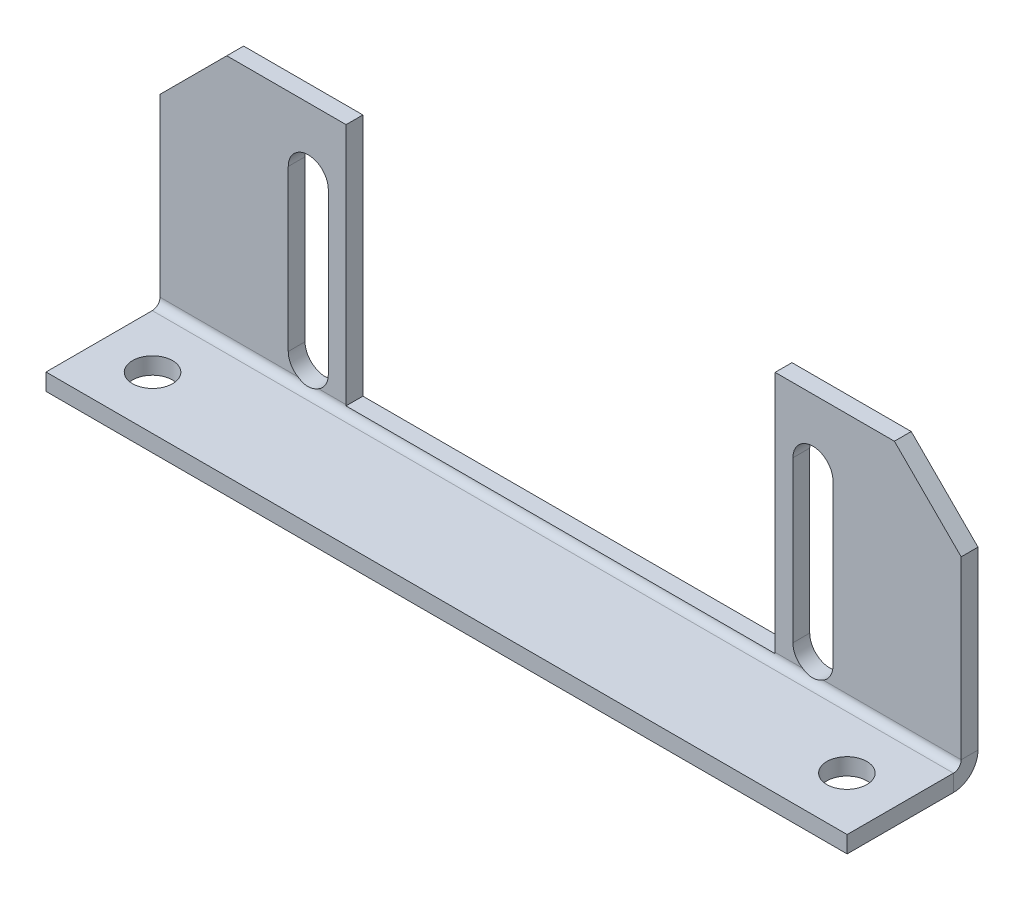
ISO-10303-21;
HEADER;
FILE_DESCRIPTION(('STEP AP214'),'2;1');
FILE_NAME('part.step','',(''),(''),'','','');
FILE_SCHEMA(('AUTOMOTIVE_DESIGN { 1 0 10303 214 1 1 1 1 }'));
ENDSEC;
DATA;
#1=APPLICATION_CONTEXT('core data for automotive mechanical design processes');
#2=APPLICATION_PROTOCOL_DEFINITION('international standard','automotive_design',2000,#1);
#3=PRODUCT_CONTEXT('',#1,'mechanical');
#4=PRODUCT('Part','Part','',(#3));
#5=PRODUCT_RELATED_PRODUCT_CATEGORY('part','',(#4));
#6=PRODUCT_DEFINITION_FORMATION('','',#4);
#7=PRODUCT_DEFINITION_CONTEXT('part definition',#1,'design');
#8=PRODUCT_DEFINITION('design','',#6,#7);
#9=PRODUCT_DEFINITION_SHAPE('','',#8);
#10=(LENGTH_UNIT() NAMED_UNIT(*) SI_UNIT(.MILLI.,.METRE.));
#11=(NAMED_UNIT(*) PLANE_ANGLE_UNIT() SI_UNIT($,.RADIAN.));
#12=(NAMED_UNIT(*) SI_UNIT($,.STERADIAN.) SOLID_ANGLE_UNIT());
#13=UNCERTAINTY_MEASURE_WITH_UNIT(LENGTH_MEASURE(1.E-05),#10,'distance_accuracy_value','');
#14=(GEOMETRIC_REPRESENTATION_CONTEXT(3) GLOBAL_UNCERTAINTY_ASSIGNED_CONTEXT((#13)) GLOBAL_UNIT_ASSIGNED_CONTEXT((#10,
#11,#12)) REPRESENTATION_CONTEXT('',''));
#15=CARTESIAN_POINT('',(0.,0.,0.));
#16=DIRECTION('',(0.,0.,1.));
#17=DIRECTION('',(1.,0.,0.));
#18=AXIS2_PLACEMENT_3D('',#15,#16,#17);
#19=CARTESIAN_POINT('',(-38.1,0.736599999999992,-3.8862));
#20=DIRECTION('',(-1.,0.,0.));
#21=DIRECTION('',(0.,0.,-1.));
#22=AXIS2_PLACEMENT_3D('',#19,#20,#21);
#23=CYLINDRICAL_SURFACE('',#22,2.3368);
#24=CARTESIAN_POINT('',(24.9848058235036,0.736600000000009,-6.223));
#25=CARTESIAN_POINT('',(24.9389985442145,0.708930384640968,-6.22299248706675));
#26=CARTESIAN_POINT('',(24.8920266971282,0.68320353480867,-6.22250828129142));
#27=CARTESIAN_POINT('',(24.7960990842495,0.635795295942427,-6.2209471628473));
#28=CARTESIAN_POINT('',(24.7471435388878,0.614113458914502,-6.21987031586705));
#29=CARTESIAN_POINT('',(24.6476242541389,0.574965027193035,-6.21748541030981));
#30=CARTESIAN_POINT('',(24.597061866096,0.557494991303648,-6.21617754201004));
#31=CARTESIAN_POINT('',(24.4946610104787,0.526866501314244,-6.21361889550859));
#32=CARTESIAN_POINT('',(24.4428225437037,0.513708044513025,-6.21236811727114));
#33=CARTESIAN_POINT('',(24.2858844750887,0.480849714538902,-6.20907400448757));
#34=CARTESIAN_POINT('',(24.179308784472,0.467745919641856,-6.20748708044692));
#35=CARTESIAN_POINT('',(23.9654909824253,0.459606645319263,-6.20652767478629));
#36=CARTESIAN_POINT('',(23.8582487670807,0.46457405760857,-6.20715554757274));
#37=CARTESIAN_POINT('',(23.6465070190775,0.492350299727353,-6.21024137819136));
#38=CARTESIAN_POINT('',(23.541999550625,0.515099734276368,-6.21269324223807));
#39=CARTESIAN_POINT('',(23.3383606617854,0.577727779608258,-6.21780226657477));
#40=CARTESIAN_POINT('',(23.2392204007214,0.617577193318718,-6.22045907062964));
#41=CARTESIAN_POINT('',(23.1222443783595,0.676389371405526,-6.22224962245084));
#42=CARTESIAN_POINT('',(23.1004936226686,0.687859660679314,-6.22252162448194));
#43=CARTESIAN_POINT('',(23.0574813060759,0.711617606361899,-6.22289687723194));
#44=CARTESIAN_POINT('',(23.0362191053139,0.723904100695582,-6.22300036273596));
#45=CARTESIAN_POINT('',(23.015194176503,0.73660000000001,-6.223));
#46=B_SPLINE_CURVE_WITH_KNOTS('',3,(#24,#25,#26,#27,#28,#29,#30,#31,#32,#33,#34,#35,#36,#37,#38,
#39,#40,#41,#42,#43,#44,#45),.UNSPECIFIED.,.F.,.F.,(4,2,2,2,2,2,2,2,2,2,4),(0.,
0.160485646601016,0.32095350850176,0.481289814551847,0.641626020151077,0.962128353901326,
1.28268197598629,1.60216944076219,1.92111355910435,1.99487714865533,2.06853787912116),.UNSPECIFIED.);
#47=CARTESIAN_POINT('',(24.9848058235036,0.736600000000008,-6.223));
#48=VERTEX_POINT('',#47);
#49=CARTESIAN_POINT('',(23.015194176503,0.736600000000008,-6.223));
#50=VERTEX_POINT('',#49);
#51=EDGE_CURVE('E386',#48,#50,#46,.T.);
#52=ORIENTED_EDGE('',*,*,#51,.F.);
#53=DIRECTION('',(-1.,0.,0.));
#54=VECTOR('',#53,1.);
#55=CARTESIAN_POINT('',(38.1,0.736600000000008,-6.223));
#56=LINE('',#55,#54);
#57=CARTESIAN_POINT('',(38.1,0.736599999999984,-6.223));
#58=VERTEX_POINT('',#57);
#59=EDGE_CURVE('E498',#48,#58,#56,.F.);
#60=ORIENTED_EDGE('',*,*,#59,.T.);
#61=CARTESIAN_POINT('',(38.1,0.736599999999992,-3.8862));
#62=DIRECTION('',(-1.,0.,0.));
#63=DIRECTION('',(0.,0.,1.));
#64=AXIS2_PLACEMENT_3D('',#61,#62,#63);
#65=CIRCLE('',#64,2.3368);
#66=CARTESIAN_POINT('',(38.1,-1.6002,-3.8862));
#67=VERTEX_POINT('',#66);
#68=EDGE_CURVE('E513',#67,#58,#65,.F.);
#69=ORIENTED_EDGE('',*,*,#68,.F.);
#70=DIRECTION('',(-1.,0.,0.));
#71=VECTOR('',#70,1.);
#72=CARTESIAN_POINT('',(-38.1,-1.60020000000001,-3.8862));
#73=LINE('',#72,#71);
#74=CARTESIAN_POINT('',(-38.1,-1.60020000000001,-3.8862));
#75=VERTEX_POINT('',#74);
#76=EDGE_CURVE('E510',#75,#67,#73,.F.);
#77=ORIENTED_EDGE('',*,*,#76,.F.);
#78=CARTESIAN_POINT('',(-38.1,0.736599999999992,-3.8862));
#79=DIRECTION('',(-1.,0.,0.));
#80=DIRECTION('',(0.,0.,1.));
#81=AXIS2_PLACEMENT_3D('',#78,#79,#80);
#82=CIRCLE('',#81,2.3368);
#83=CARTESIAN_POINT('',(-38.1,0.736600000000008,-6.223));
#84=VERTEX_POINT('',#83);
#85=EDGE_CURVE('E514',#84,#75,#82,.T.);
#86=ORIENTED_EDGE('',*,*,#85,.F.);
#87=CARTESIAN_POINT('',(-24.9848058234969,0.736600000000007,-6.223));
#88=VERTEX_POINT('',#87);
#89=EDGE_CURVE('E494',#84,#88,#56,.F.);
#90=ORIENTED_EDGE('',*,*,#89,.T.);
#91=CARTESIAN_POINT('',(-23.0151941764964,0.736600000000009,-6.223));
#92=CARTESIAN_POINT('',(-23.0610014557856,0.708930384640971,-6.22299248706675));
#93=CARTESIAN_POINT('',(-23.1079733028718,0.683203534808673,-6.22250828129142));
#94=CARTESIAN_POINT('',(-23.2039009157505,0.635795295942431,-6.2209471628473));
#95=CARTESIAN_POINT('',(-23.2528564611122,0.614113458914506,-6.21987031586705));
#96=CARTESIAN_POINT('',(-23.3523757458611,0.57496502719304,-6.21748541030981));
#97=CARTESIAN_POINT('',(-23.402938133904,0.557494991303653,-6.21617754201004));
#98=CARTESIAN_POINT('',(-23.5053389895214,0.526866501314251,-6.21361889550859));
#99=CARTESIAN_POINT('',(-23.5571774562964,0.513708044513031,-6.21236811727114));
#100=CARTESIAN_POINT('',(-23.7141155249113,0.48084971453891,-6.20907400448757));
#101=CARTESIAN_POINT('',(-23.820691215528,0.467745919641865,-6.20748708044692));
#102=CARTESIAN_POINT('',(-24.0345090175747,0.459606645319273,-6.20652767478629));
#103=CARTESIAN_POINT('',(-24.1417512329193,0.464574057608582,-6.20715554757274));
#104=CARTESIAN_POINT('',(-24.3534929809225,0.492350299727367,-6.21024137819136));
#105=CARTESIAN_POINT('',(-24.458000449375,0.515099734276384,-6.21269324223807));
#106=CARTESIAN_POINT('',(-24.6616393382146,0.577727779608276,-6.21780226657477));
#107=CARTESIAN_POINT('',(-24.7607795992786,0.617577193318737,-6.22045907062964));
#108=CARTESIAN_POINT('',(-24.8777556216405,0.676389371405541,-6.22224962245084));
#109=CARTESIAN_POINT('',(-24.8995063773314,0.687859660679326,-6.22252162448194));
#110=CARTESIAN_POINT('',(-24.9425186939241,0.711617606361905,-6.22289687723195));
#111=CARTESIAN_POINT('',(-24.9637808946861,0.723904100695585,-6.22300036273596));
#112=CARTESIAN_POINT('',(-24.9848058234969,0.736600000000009,-6.223));
#113=B_SPLINE_CURVE_WITH_KNOTS('',3,(#91,#92,#93,#94,#95,#96,#97,#98,#99,#100,#101,#102,#103,
#104,#105,#106,#107,#108,#109,#110,#111,#112),.UNSPECIFIED.,.F.,.F.,(4,2,2,2,2,2,2,2,2,2,4),(0.,
0.160485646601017,0.320953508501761,0.481289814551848,0.641626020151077,0.962128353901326,
1.28268197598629,1.6021694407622,1.92111355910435,1.99487714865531,2.06853787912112),.UNSPECIFIED.);
#114=CARTESIAN_POINT('',(-23.0151941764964,0.736600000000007,-6.223));
#115=VERTEX_POINT('',#114);
#116=EDGE_CURVE('E339',#115,#88,#113,.T.);
#117=ORIENTED_EDGE('',*,*,#116,.F.);
#118=CARTESIAN_POINT('',(-20.4040000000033,0.736599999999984,-6.223));
#119=VERTEX_POINT('',#118);
#120=EDGE_CURVE('E497',#115,#119,#56,.F.);
#121=ORIENTED_EDGE('',*,*,#120,.T.);
#122=CARTESIAN_POINT('',(-20.4040000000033,0.736599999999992,-3.8862));
#123=DIRECTION('',(-1.,0.,0.));
#124=DIRECTION('',(0.,0.,1.));
#125=AXIS2_PLACEMENT_3D('',#122,#123,#124);
#126=CIRCLE('',#125,2.3368);
#127=CARTESIAN_POINT('',(-20.4040000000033,0.634999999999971,-6.22079025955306));
#128=VERTEX_POINT('',#127);
#129=EDGE_CURVE('E321',#128,#119,#126,.F.);
#130=ORIENTED_EDGE('',*,*,#129,.F.);
#131=DIRECTION('',(-1.,0.,0.));
#132=VECTOR('',#131,1.);
#133=CARTESIAN_POINT('',(-38.1,0.634999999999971,-6.22079025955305));
#134=LINE('',#133,#132);
#135=CARTESIAN_POINT('',(20.4040000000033,0.634999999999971,-6.22079025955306));
#136=VERTEX_POINT('',#135);
#137=EDGE_CURVE('E393',#128,#136,#134,.F.);
#138=ORIENTED_EDGE('',*,*,#137,.T.);
#139=CARTESIAN_POINT('',(20.4040000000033,0.736599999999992,-3.8862));
#140=DIRECTION('',(-1.,0.,0.));
#141=DIRECTION('',(0.,0.,1.));
#142=AXIS2_PLACEMENT_3D('',#139,#140,#141);
#143=CIRCLE('',#142,2.3368);
#144=CARTESIAN_POINT('',(20.4040000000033,0.736599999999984,-6.223));
#145=VERTEX_POINT('',#144);
#146=EDGE_CURVE('E328',#136,#145,#143,.F.);
#147=ORIENTED_EDGE('',*,*,#146,.T.);
#148=EDGE_CURVE('E561',#145,#50,#56,.F.);
#149=ORIENTED_EDGE('',*,*,#148,.T.);
#150=EDGE_LOOP('',(#52,#60,#69,#77,#86,#90,#117,#121,#130,#138,#147,#149));
#151=FACE_BOUND('',#150,.T.);
#152=ADVANCED_FACE('F61',(#151),#23,.T.);
#153=CARTESIAN_POINT('',(-38.1,0.736599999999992,-3.8862));
#154=DIRECTION('',(-1.,0.,0.));
#155=DIRECTION('',(0.,0.,-1.));
#156=AXIS2_PLACEMENT_3D('',#153,#154,#155);
#157=CYLINDRICAL_SURFACE('',#156,0.7366);
#158=DIRECTION('',(-1.,0.,0.));
#159=VECTOR('',#158,1.);
#160=CARTESIAN_POINT('',(38.1,0.736599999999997,-4.6228));
#161=LINE('',#160,#159);
#162=CARTESIAN_POINT('',(38.1,0.736599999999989,-4.6228));
#163=VERTEX_POINT('',#162);
#164=CARTESIAN_POINT('',(24.9848058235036,0.736599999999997,-4.6228));
#165=VERTEX_POINT('',#164);
#166=EDGE_CURVE('E502',#163,#165,#161,.T.);
#167=ORIENTED_EDGE('',*,*,#166,.T.);
#168=CARTESIAN_POINT('',(24.9848058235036,0.736599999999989,-4.6228));
#169=CARTESIAN_POINT('',(24.8997809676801,0.685256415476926,-4.62280716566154));
#170=CARTESIAN_POINT('',(24.8106646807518,0.640550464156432,-4.61749873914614));
#171=CARTESIAN_POINT('',(24.6265400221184,0.565516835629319,-4.60367951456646));
#172=CARTESIAN_POINT('',(24.5315097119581,0.535246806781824,-4.59515611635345));
#173=CARTESIAN_POINT('',(24.3842602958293,0.500739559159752,-4.5841223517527));
#174=CARTESIAN_POINT('',(24.3333653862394,0.490979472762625,-4.58068856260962));
#175=CARTESIAN_POINT('',(24.2308687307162,0.475631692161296,-4.57507183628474));
#176=CARTESIAN_POINT('',(24.1792669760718,0.470044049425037,-4.5728889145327));
#177=CARTESIAN_POINT('',(24.0758305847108,0.463105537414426,-4.57015465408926));
#178=CARTESIAN_POINT('',(24.0239965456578,0.461746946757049,-4.56960034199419));
#179=CARTESIAN_POINT('',(23.9204028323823,0.463258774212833,-4.57020642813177));
#180=CARTESIAN_POINT('',(23.8686431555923,0.46612904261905,-4.57136676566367));
#181=CARTESIAN_POINT('',(23.7666848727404,0.475963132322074,-4.5751666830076));
#182=CARTESIAN_POINT('',(23.7164765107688,0.482838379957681,-4.57777419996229));
#183=CARTESIAN_POINT('',(23.6168214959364,0.500547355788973,-4.58401423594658));
#184=CARTESIAN_POINT('',(23.5673752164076,0.51138296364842,-4.5876472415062));
#185=CARTESIAN_POINT('',(23.4204945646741,0.549766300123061,-4.59922277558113));
#186=CARTESIAN_POINT('',(23.3245639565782,0.583186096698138,-4.60783917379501));
#187=CARTESIAN_POINT('',(23.1577953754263,0.656663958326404,-4.61918780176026));
#188=CARTESIAN_POINT('',(23.0858051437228,0.694014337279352,-4.62275741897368));
#189=CARTESIAN_POINT('',(22.9471989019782,0.777607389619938,-4.62284173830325));
#190=CARTESIAN_POINT('',(22.880568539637,0.823825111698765,-4.61937598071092));
#191=CARTESIAN_POINT('',(22.7755062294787,0.906976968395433,-4.60362529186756));
#192=CARTESIAN_POINT('',(22.7350287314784,0.941936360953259,-4.59463083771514));
#193=CARTESIAN_POINT('',(22.6582770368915,1.01395076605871,-4.56964968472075));
#194=CARTESIAN_POINT('',(22.6219972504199,1.05100289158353,-4.55367242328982));
#195=CARTESIAN_POINT('',(22.5609716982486,1.11834450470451,-4.51709594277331));
#196=CARTESIAN_POINT('',(22.5353387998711,1.14859925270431,-4.49792522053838));
#197=CARTESIAN_POINT('',(22.4880334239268,1.20781087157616,-4.45356685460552));
#198=CARTESIAN_POINT('',(22.4663594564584,1.23676822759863,-4.42838148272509));
#199=CARTESIAN_POINT('',(22.4272280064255,1.29186231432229,-4.37182426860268));
#200=CARTESIAN_POINT('',(22.4098004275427,1.31797836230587,-4.34041122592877));
#201=CARTESIAN_POINT('',(22.3795281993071,1.36535633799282,-4.27216271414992));
#202=CARTESIAN_POINT('',(22.3666817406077,1.38662018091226,-4.2353293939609));
#203=CARTESIAN_POINT('',(22.3467777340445,1.42060930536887,-4.16213781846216));
#204=CARTESIAN_POINT('',(22.3392121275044,1.43405095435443,-4.12624796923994));
#205=CARTESIAN_POINT('',(22.3274719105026,1.455256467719,-4.05230226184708));
#206=CARTESIAN_POINT('',(22.3232962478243,1.46302209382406,-4.01424707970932));
#207=CARTESIAN_POINT('',(22.3183703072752,1.47221785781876,-3.93915351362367));
#208=CARTESIAN_POINT('',(22.3174558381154,1.47395156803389,-3.90216259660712));
#209=CARTESIAN_POINT('',(22.318571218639,1.47185385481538,-3.82838637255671));
#210=CARTESIAN_POINT('',(22.3206006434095,1.46802323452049,-3.79160103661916));
#211=CARTESIAN_POINT('',(22.327619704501,1.45503786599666,-3.71960722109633));
#212=CARTESIAN_POINT('',(22.3325836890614,1.44592926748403,-3.68438788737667));
#213=CARTESIAN_POINT('',(22.345539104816,1.42286478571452,-3.61616947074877));
#214=CARTESIAN_POINT('',(22.3535303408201,1.40890921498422,-3.58317024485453));
#215=CARTESIAN_POINT('',(22.3727210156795,1.37667313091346,-3.51992343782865));
#216=CARTESIAN_POINT('',(22.3839522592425,1.35835007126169,-3.48970725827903));
#217=CARTESIAN_POINT('',(22.4096062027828,1.31837902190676,-3.43308344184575));
#218=CARTESIAN_POINT('',(22.4240291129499,1.29673081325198,-3.40667605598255));
#219=CARTESIAN_POINT('',(22.4567228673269,1.25008647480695,-3.35692932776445));
#220=CARTESIAN_POINT('',(22.4751416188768,1.22498138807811,-3.33379011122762));
#221=CARTESIAN_POINT('',(22.5151330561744,1.1734564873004,-3.29220109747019));
#222=CARTESIAN_POINT('',(22.5367072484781,1.14703604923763,-3.27375355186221));
#223=CARTESIAN_POINT('',(22.5919122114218,1.08327493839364,-3.23482038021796));
#224=CARTESIAN_POINT('',(22.626909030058,1.04580268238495,-3.21648262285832));
#225=CARTESIAN_POINT('',(22.701423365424,0.972496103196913,-3.18727367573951));
#226=CARTESIAN_POINT('',(22.7409494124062,0.936665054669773,-3.17641685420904));
#227=CARTESIAN_POINT('',(22.8419063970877,0.852757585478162,-3.15703599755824));
#228=CARTESIAN_POINT('',(22.9052757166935,0.806300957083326,-3.15168379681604));
#229=CARTESIAN_POINT('',(23.0374386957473,0.721481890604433,-3.14852770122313));
#230=CARTESIAN_POINT('',(23.1062470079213,0.683142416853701,-3.1507449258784));
#231=CARTESIAN_POINT('',(23.2251957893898,0.626162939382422,-3.15755814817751));
#232=CARTESIAN_POINT('',(23.2742808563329,0.605141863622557,-3.16116842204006));
#233=CARTESIAN_POINT('',(23.3739927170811,0.567304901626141,-3.16905761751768));
#234=CARTESIAN_POINT('',(23.4246193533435,0.550488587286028,-3.17333647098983));
#235=CARTESIAN_POINT('',(23.5270713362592,0.521168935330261,-3.18164267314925));
#236=CARTESIAN_POINT('',(23.5788954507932,0.50866135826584,-3.18567026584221));
#237=CARTESIAN_POINT('',(23.6834713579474,0.488025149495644,-3.19272358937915));
#238=CARTESIAN_POINT('',(23.7362229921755,0.479895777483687,-3.1957494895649));
#239=CARTESIAN_POINT('',(23.8423308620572,0.468085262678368,-3.20025547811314));
#240=CARTESIAN_POINT('',(23.8956875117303,0.464407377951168,-3.20173443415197));
#241=CARTESIAN_POINT('',(24.0025419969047,0.461552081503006,-3.20287682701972));
#242=CARTESIAN_POINT('',(24.0560398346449,0.462374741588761,-3.20254023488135));
#243=CARTESIAN_POINT('',(24.1627963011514,0.468515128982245,-3.2001087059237));
#244=CARTESIAN_POINT('',(24.2160545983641,0.473837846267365,-3.19801181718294));
#245=CARTESIAN_POINT('',(24.3218509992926,0.488924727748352,-3.19244322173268));
#246=CARTESIAN_POINT('',(24.374389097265,0.498688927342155,-3.18897150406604));
#247=CARTESIAN_POINT('',(24.5249204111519,0.533261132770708,-3.17781234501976));
#248=CARTESIAN_POINT('',(24.6215872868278,0.563715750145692,-3.16912965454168));
#249=CARTESIAN_POINT('',(24.8090076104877,0.639666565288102,-3.15498975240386));
#250=CARTESIAN_POINT('',(24.8997702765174,0.685138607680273,-3.14952739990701));
#251=CARTESIAN_POINT('',(25.0410877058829,0.770658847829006,-3.14964686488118));
#252=CARTESIAN_POINT('',(25.094152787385,0.806550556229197,-3.15190555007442));
#253=CARTESIAN_POINT('',(25.1959390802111,0.883122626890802,-3.16328560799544));
#254=CARTESIAN_POINT('',(25.2446673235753,0.923794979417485,-3.17239563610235));
#255=CARTESIAN_POINT('',(25.3261696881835,0.998850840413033,-3.19700171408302));
#256=CARTESIAN_POINT('',(25.3600761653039,1.03260964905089,-3.21061667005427));
#257=CARTESIAN_POINT('',(25.4236579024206,1.10065902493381,-3.24473071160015));
#258=CARTESIAN_POINT('',(25.4533384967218,1.13494886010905,-3.26522100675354));
#259=CARTESIAN_POINT('',(25.5030827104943,1.19637740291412,-3.3096869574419));
#260=CARTESIAN_POINT('',(25.5239234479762,1.22374083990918,-3.33247796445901));
#261=CARTESIAN_POINT('',(25.5618364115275,1.27609158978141,-3.3833501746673));
#262=CARTESIAN_POINT('',(25.5789096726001,1.30107955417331,-3.41142992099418));
#263=CARTESIAN_POINT('',(25.6091795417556,1.34733080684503,-3.47260142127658));
#264=CARTESIAN_POINT('',(25.6223582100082,1.36857668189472,-3.50571533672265));
#265=CARTESIAN_POINT('',(25.6447364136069,1.4058721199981,-3.5759822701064));
#266=CARTESIAN_POINT('',(25.6539364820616,1.42192237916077,-3.61313474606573));
#267=CARTESIAN_POINT('',(25.6678641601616,1.44673498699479,-3.68700658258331));
#268=CARTESIAN_POINT('',(25.6729020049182,1.45599542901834,-3.72350123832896));
#269=CARTESIAN_POINT('',(25.6798367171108,1.46884130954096,-3.79776330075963));
#270=CARTESIAN_POINT('',(25.6817343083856,1.47242805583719,-3.83553041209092));
#271=CARTESIAN_POINT('',(25.6824252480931,1.47372834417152,-3.9100568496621));
#272=CARTESIAN_POINT('',(25.6813098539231,1.47161454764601,-3.94681248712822));
#273=CARTESIAN_POINT('',(25.6761424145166,1.46198176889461,-4.01939370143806));
#274=CARTESIAN_POINT('',(25.6720906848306,1.45446336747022,-4.05521937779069));
#275=CARTESIAN_POINT('',(25.6609806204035,1.43440217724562,-4.12486838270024));
#276=CARTESIAN_POINT('',(25.6539279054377,1.42186878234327,-4.15869532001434));
#277=CARTESIAN_POINT('',(25.636726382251,1.39239417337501,-4.22351480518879));
#278=CARTESIAN_POINT('',(25.6265776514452,1.37545306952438,-4.25450742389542));
#279=CARTESIAN_POINT('',(25.6029144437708,1.33764231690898,-4.31349179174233));
#280=CARTESIAN_POINT('',(25.5893393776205,1.31670380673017,-4.34141490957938));
#281=CARTESIAN_POINT('',(25.5589855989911,1.27216791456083,-4.39306349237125));
#282=CARTESIAN_POINT('',(25.5422065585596,1.24857026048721,-4.41678852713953));
#283=CARTESIAN_POINT('',(25.5043718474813,1.19813465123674,-4.46132906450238));
#284=CARTESIAN_POINT('',(25.483102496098,1.17118546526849,-4.48183560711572));
#285=CARTESIAN_POINT('',(25.4374522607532,1.11669021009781,-4.51800962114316));
#286=CARTESIAN_POINT('',(25.4130689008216,1.08914368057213,-4.53367320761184));
#287=CARTESIAN_POINT('',(25.3488381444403,1.02089846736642,-4.56725164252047));
#288=CARTESIAN_POINT('',(25.3073109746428,0.980439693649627,-4.58244229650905));
#289=CARTESIAN_POINT('',(25.2195378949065,0.902645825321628,-4.60498848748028));
#290=CARTESIAN_POINT('',(25.1732862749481,0.865314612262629,-4.61233441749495));
#291=CARTESIAN_POINT('',(25.1025783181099,0.813549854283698,-4.6189600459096));
#292=CARTESIAN_POINT('',(25.0795052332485,0.797431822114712,-4.62045075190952));
#293=CARTESIAN_POINT('',(25.0326656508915,0.766232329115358,-4.62236907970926));
#294=CARTESIAN_POINT('',(25.0089000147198,0.751149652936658,-4.62279796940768));
#295=CARTESIAN_POINT('',(24.9848058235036,0.736599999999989,-4.6228));
#296=B_SPLINE_CURVE_WITH_KNOTS('',3,(#168,#169,#170,#171,#172,#173,#174,#175,#176,#177,#178,
#179,#180,#181,#182,#183,#184,#185,#186,#187,#188,#189,#190,#191,#192,#193,#194,#195,#196,#197,
#198,#199,#200,#201,#202,#203,#204,#205,#206,#207,#208,#209,#210,#211,#212,#213,#214,#215,#216,
#217,#218,#219,#220,#221,#222,#223,#224,#225,#226,#227,#228,#229,#230,#231,#232,#233,#234,#235,
#236,#237,#238,#239,#240,#241,#242,#243,#244,#245,#246,#247,#248,#249,#250,#251,#252,#253,#254,
#255,#256,#257,#258,#259,#260,#261,#262,#263,#264,#265,#266,#267,#268,#269,#270,#271,#272,#273,
#274,#275,#276,#277,#278,#279,#280,#281,#282,#283,#284,#285,#286,#287,#288,#289,#290,#291,#292,
#293,#294,#295),.UNSPECIFIED.,.T.,.F.,(4,2,2,2,2,2,2,2,2,2,2,2,2,2,2,2,2,2,2,2,2,2,2,2,2,2,2,2,
2,2,2,2,2,2,2,2,2,2,2,2,2,2,2,2,2,2,2,2,2,2,2,2,2,2,2,2,2,2,2,2,2,2,2,4),(0.,0.297886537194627,
0.596952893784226,0.752599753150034,0.908248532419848,1.06361296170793,1.21897189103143,
1.3710187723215,1.52313791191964,1.82751227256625,2.0703562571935,2.312526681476,
2.47472137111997,2.6366975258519,2.76830041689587,2.89985367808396,3.03230818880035,
3.16471032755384,3.2813033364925,3.39786014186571,3.50845865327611,3.61904120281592,
3.7286711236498,3.83829397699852,3.9490318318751,4.05977698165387,4.17567904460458,
4.29163662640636,4.45408188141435,4.61683827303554,4.85180148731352,5.08742080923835,
5.24779881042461,5.40816047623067,5.56836390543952,5.728540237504,5.88883373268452,
6.04912978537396,6.20960381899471,6.37007913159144,6.67392954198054,6.97729357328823,
7.16907960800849,7.36054877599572,7.50924744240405,7.65775671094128,7.78101986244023,
7.90424910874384,8.0280374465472,8.15180919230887,8.2652067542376,8.3785781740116,
8.48855459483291,8.59851919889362,8.70827877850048,8.81803561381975,8.92988902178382,
9.04175388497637,9.16125119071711,9.28084410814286,9.45964092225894,9.6386564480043,
9.72317196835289,9.80758652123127),.UNSPECIFIED.);
#297=CARTESIAN_POINT('',(23.0151941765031,0.736599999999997,-4.6228));
#298=VERTEX_POINT('',#297);
#299=EDGE_CURVE('E394',#165,#298,#296,.T.);
#300=ORIENTED_EDGE('',*,*,#299,.T.);
#301=CARTESIAN_POINT('',(20.4040000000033,0.736599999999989,-4.6228));
#302=VERTEX_POINT('',#301);
#303=EDGE_CURVE('E505',#298,#302,#161,.T.);
#304=ORIENTED_EDGE('',*,*,#303,.T.);
#305=CARTESIAN_POINT('',(20.4040000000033,0.736599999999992,-3.8862));
#306=DIRECTION('',(-1.,0.,0.));
#307=DIRECTION('',(0.,0.,1.));
#308=AXIS2_PLACEMENT_3D('',#305,#306,#307);
#309=CIRCLE('',#308,0.7366);
#310=CARTESIAN_POINT('',(20.4040000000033,0.634999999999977,-4.61575945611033));
#311=VERTEX_POINT('',#310);
#312=EDGE_CURVE('E326',#311,#302,#309,.F.);
#313=ORIENTED_EDGE('',*,*,#312,.F.);
#314=DIRECTION('',(-1.,0.,0.));
#315=VECTOR('',#314,1.);
#316=CARTESIAN_POINT('',(-38.1,0.634999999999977,-4.61575945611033));
#317=LINE('',#316,#315);
#318=CARTESIAN_POINT('',(-20.4040000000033,0.634999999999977,-4.61575945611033));
#319=VERTEX_POINT('',#318);
#320=EDGE_CURVE('E458',#319,#311,#317,.F.);
#321=ORIENTED_EDGE('',*,*,#320,.F.);
#322=CARTESIAN_POINT('',(-20.4040000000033,0.736599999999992,-3.8862));
#323=DIRECTION('',(-1.,0.,0.));
#324=DIRECTION('',(0.,0.,1.));
#325=AXIS2_PLACEMENT_3D('',#322,#323,#324);
#326=CIRCLE('',#325,0.7366);
#327=CARTESIAN_POINT('',(-20.4040000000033,0.736599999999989,-4.6228));
#328=VERTEX_POINT('',#327);
#329=EDGE_CURVE('E318',#319,#328,#326,.F.);
#330=ORIENTED_EDGE('',*,*,#329,.T.);
#331=CARTESIAN_POINT('',(-23.0151941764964,0.736599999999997,-4.6228));
#332=VERTEX_POINT('',#331);
#333=EDGE_CURVE('E605',#328,#332,#161,.T.);
#334=ORIENTED_EDGE('',*,*,#333,.T.);
#335=CARTESIAN_POINT('',(-23.0151941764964,0.736599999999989,-4.6228));
#336=CARTESIAN_POINT('',(-23.10021903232,0.685256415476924,-4.62280716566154));
#337=CARTESIAN_POINT('',(-23.1893353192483,0.640550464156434,-4.61749873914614));
#338=CARTESIAN_POINT('',(-23.3734599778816,0.565516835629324,-4.60367951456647));
#339=CARTESIAN_POINT('',(-23.4684902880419,0.535246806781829,-4.59515611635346));
#340=CARTESIAN_POINT('',(-23.6157397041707,0.500739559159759,-4.5841223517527));
#341=CARTESIAN_POINT('',(-23.6666346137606,0.490979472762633,-4.58068856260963));
#342=CARTESIAN_POINT('',(-23.7691312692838,0.475631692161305,-4.57507183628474));
#343=CARTESIAN_POINT('',(-23.8207330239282,0.470044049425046,-4.57288891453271));
#344=CARTESIAN_POINT('',(-23.9241694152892,0.463105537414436,-4.57015465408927));
#345=CARTESIAN_POINT('',(-23.9760034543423,0.461746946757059,-4.56960034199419));
#346=CARTESIAN_POINT('',(-24.0795971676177,0.463258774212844,-4.57020642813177));
#347=CARTESIAN_POINT('',(-24.1313568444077,0.466129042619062,-4.57136676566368));
#348=CARTESIAN_POINT('',(-24.2333151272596,0.475963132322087,-4.5751666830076));
#349=CARTESIAN_POINT('',(-24.2835234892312,0.482838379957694,-4.5777741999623));
#350=CARTESIAN_POINT('',(-24.3831785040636,0.500547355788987,-4.58401423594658));
#351=CARTESIAN_POINT('',(-24.4326247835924,0.511382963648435,-4.58764724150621));
#352=CARTESIAN_POINT('',(-24.5795054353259,0.549766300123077,-4.59922277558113));
#353=CARTESIAN_POINT('',(-24.6754360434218,0.583186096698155,-4.60783917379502));
#354=CARTESIAN_POINT('',(-24.8422046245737,0.656663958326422,-4.61918780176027));
#355=CARTESIAN_POINT('',(-24.9141948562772,0.69401433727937,-4.62275741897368));
#356=CARTESIAN_POINT('',(-25.0528010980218,0.777607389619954,-4.62284173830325));
#357=CARTESIAN_POINT('',(-25.119431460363,0.823825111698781,-4.61937598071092));
#358=CARTESIAN_POINT('',(-25.2244937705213,0.906976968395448,-4.60362529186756));
#359=CARTESIAN_POINT('',(-25.2649712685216,0.941936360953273,-4.59463083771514));
#360=CARTESIAN_POINT('',(-25.3417229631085,1.01395076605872,-4.56964968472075));
#361=CARTESIAN_POINT('',(-25.3780027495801,1.05100289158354,-4.55367242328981));
#362=CARTESIAN_POINT('',(-25.4390283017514,1.11834450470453,-4.5170959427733));
#363=CARTESIAN_POINT('',(-25.4646612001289,1.14859925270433,-4.49792522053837));
#364=CARTESIAN_POINT('',(-25.5119665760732,1.20781087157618,-4.45356685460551));
#365=CARTESIAN_POINT('',(-25.5336405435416,1.23676822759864,-4.42838148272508));
#366=CARTESIAN_POINT('',(-25.5727719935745,1.2918623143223,-4.37182426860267));
#367=CARTESIAN_POINT('',(-25.5901995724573,1.31797836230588,-4.34041122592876));
#368=CARTESIAN_POINT('',(-25.6204718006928,1.36535633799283,-4.27216271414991));
#369=CARTESIAN_POINT('',(-25.6333182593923,1.38662018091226,-4.23532939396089));
#370=CARTESIAN_POINT('',(-25.6532222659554,1.42060930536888,-4.16213781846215));
#371=CARTESIAN_POINT('',(-25.6607878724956,1.43405095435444,-4.12624796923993));
#372=CARTESIAN_POINT('',(-25.6725280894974,1.45525646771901,-4.05230226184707));
#373=CARTESIAN_POINT('',(-25.6767037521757,1.46302209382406,-4.01424707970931));
#374=CARTESIAN_POINT('',(-25.6816296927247,1.47221785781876,-3.93915351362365));
#375=CARTESIAN_POINT('',(-25.6825441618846,1.47395156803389,-3.9021625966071));
#376=CARTESIAN_POINT('',(-25.681428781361,1.47185385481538,-3.8283863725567));
#377=CARTESIAN_POINT('',(-25.6793993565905,1.46802323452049,-3.79160103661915));
#378=CARTESIAN_POINT('',(-25.672380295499,1.45503786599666,-3.71960722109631));
#379=CARTESIAN_POINT('',(-25.6674163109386,1.44592926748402,-3.68438788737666));
#380=CARTESIAN_POINT('',(-25.6544608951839,1.42286478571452,-3.61616947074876));
#381=CARTESIAN_POINT('',(-25.6464696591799,1.40890921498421,-3.58317024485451));
#382=CARTESIAN_POINT('',(-25.6272789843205,1.37667313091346,-3.51992343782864));
#383=CARTESIAN_POINT('',(-25.6160477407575,1.35835007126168,-3.48970725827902));
#384=CARTESIAN_POINT('',(-25.5903937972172,1.31837902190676,-3.43308344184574));
#385=CARTESIAN_POINT('',(-25.5759708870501,1.29673081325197,-3.40667605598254));
#386=CARTESIAN_POINT('',(-25.5432771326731,1.25008647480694,-3.35692932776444));
#387=CARTESIAN_POINT('',(-25.5248583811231,1.22498138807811,-3.33379011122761));
#388=CARTESIAN_POINT('',(-25.4848669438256,1.17345648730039,-3.29220109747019));
#389=CARTESIAN_POINT('',(-25.4632927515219,1.14703604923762,-3.27375355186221));
#390=CARTESIAN_POINT('',(-25.4080877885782,1.08327493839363,-3.23482038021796));
#391=CARTESIAN_POINT('',(-25.373090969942,1.04580268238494,-3.21648262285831));
#392=CARTESIAN_POINT('',(-25.298576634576,0.972496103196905,-3.1872736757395));
#393=CARTESIAN_POINT('',(-25.2590505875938,0.936665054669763,-3.17641685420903));
#394=CARTESIAN_POINT('',(-25.1580936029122,0.852757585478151,-3.15703599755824));
#395=CARTESIAN_POINT('',(-25.0947242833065,0.806300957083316,-3.15168379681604));
#396=CARTESIAN_POINT('',(-24.9625613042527,0.721481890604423,-3.14852770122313));
#397=CARTESIAN_POINT('',(-24.8937529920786,0.683142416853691,-3.1507449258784));
#398=CARTESIAN_POINT('',(-24.7748042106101,0.626162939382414,-3.15755814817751));
#399=CARTESIAN_POINT('',(-24.725719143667,0.60514186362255,-3.16116842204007));
#400=CARTESIAN_POINT('',(-24.6260072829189,0.567304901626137,-3.16905761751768));
#401=CARTESIAN_POINT('',(-24.5753806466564,0.550488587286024,-3.17333647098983));
#402=CARTESIAN_POINT('',(-24.4729286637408,0.52116893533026,-3.18164267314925));
#403=CARTESIAN_POINT('',(-24.4211045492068,0.50866135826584,-3.18567026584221));
#404=CARTESIAN_POINT('',(-24.3165286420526,0.488025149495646,-3.19272358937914));
#405=CARTESIAN_POINT('',(-24.2637770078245,0.479895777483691,-3.1957494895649));
#406=CARTESIAN_POINT('',(-24.1576691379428,0.468085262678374,-3.20025547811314));
#407=CARTESIAN_POINT('',(-24.1043124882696,0.464407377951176,-3.20173443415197));
#408=CARTESIAN_POINT('',(-23.9974580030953,0.461552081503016,-3.20287682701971));
#409=CARTESIAN_POINT('',(-23.943960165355,0.462374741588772,-3.20254023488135));
#410=CARTESIAN_POINT('',(-23.8372036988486,0.468515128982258,-3.20010870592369));
#411=CARTESIAN_POINT('',(-23.7839454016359,0.47383784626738,-3.19801181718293));
#412=CARTESIAN_POINT('',(-23.6781490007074,0.48892472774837,-3.19244322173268));
#413=CARTESIAN_POINT('',(-23.6256109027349,0.498688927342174,-3.18897150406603));
#414=CARTESIAN_POINT('',(-23.475079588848,0.53326113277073,-3.17781234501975));
#415=CARTESIAN_POINT('',(-23.3784127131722,0.563715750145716,-3.16912965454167));
#416=CARTESIAN_POINT('',(-23.1909923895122,0.639666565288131,-3.15498975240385));
#417=CARTESIAN_POINT('',(-23.1002297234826,0.685138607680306,-3.14952739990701));
#418=CARTESIAN_POINT('',(-22.9589122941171,0.770658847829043,-3.14964686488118));
#419=CARTESIAN_POINT('',(-22.905847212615,0.806550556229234,-3.15190555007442));
#420=CARTESIAN_POINT('',(-22.8040609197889,0.883122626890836,-3.16328560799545));
#421=CARTESIAN_POINT('',(-22.7553326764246,0.923794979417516,-3.17239563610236));
#422=CARTESIAN_POINT('',(-22.6738303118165,0.998850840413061,-3.19700171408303));
#423=CARTESIAN_POINT('',(-22.6399238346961,1.03260964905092,-3.21061667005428));
#424=CARTESIAN_POINT('',(-22.5763420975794,1.10065902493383,-3.24473071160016));
#425=CARTESIAN_POINT('',(-22.5466615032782,1.13494886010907,-3.26522100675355));
#426=CARTESIAN_POINT('',(-22.4969172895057,1.19637740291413,-3.30968695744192));
#427=CARTESIAN_POINT('',(-22.4760765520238,1.22374083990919,-3.33247796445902));
#428=CARTESIAN_POINT('',(-22.4381635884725,1.27609158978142,-3.38335017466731));
#429=CARTESIAN_POINT('',(-22.4210903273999,1.30107955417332,-3.41142992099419));
#430=CARTESIAN_POINT('',(-22.3908204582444,1.34733080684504,-3.47260142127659));
#431=CARTESIAN_POINT('',(-22.3776417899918,1.36857668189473,-3.50571533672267));
#432=CARTESIAN_POINT('',(-22.3552635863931,1.4058721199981,-3.57598227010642));
#433=CARTESIAN_POINT('',(-22.3460635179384,1.42192237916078,-3.61313474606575));
#434=CARTESIAN_POINT('',(-22.3321358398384,1.4467349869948,-3.68700658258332));
#435=CARTESIAN_POINT('',(-22.3270979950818,1.45599542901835,-3.72350123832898));
#436=CARTESIAN_POINT('',(-22.3201632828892,1.46884130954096,-3.79776330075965));
#437=CARTESIAN_POINT('',(-22.3182656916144,1.47242805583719,-3.83553041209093));
#438=CARTESIAN_POINT('',(-22.3175747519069,1.47372834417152,-3.91005684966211));
#439=CARTESIAN_POINT('',(-22.3186901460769,1.47161454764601,-3.94681248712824));
#440=CARTESIAN_POINT('',(-22.3238575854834,1.46198176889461,-4.01939370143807));
#441=CARTESIAN_POINT('',(-22.3279093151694,1.45446336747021,-4.0552193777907));
#442=CARTESIAN_POINT('',(-22.3390193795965,1.43440217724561,-4.12486838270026));
#443=CARTESIAN_POINT('',(-22.3460720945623,1.42186878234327,-4.15869532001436));
#444=CARTESIAN_POINT('',(-22.363273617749,1.392394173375,-4.2235148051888));
#445=CARTESIAN_POINT('',(-22.3734223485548,1.37545306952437,-4.25450742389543));
#446=CARTESIAN_POINT('',(-22.3970855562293,1.33764231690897,-4.31349179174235));
#447=CARTESIAN_POINT('',(-22.4106606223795,1.31670380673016,-4.34141490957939));
#448=CARTESIAN_POINT('',(-22.441014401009,1.27216791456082,-4.39306349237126));
#449=CARTESIAN_POINT('',(-22.4577934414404,1.2485702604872,-4.41678852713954));
#450=CARTESIAN_POINT('',(-22.4956281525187,1.19813465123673,-4.46132906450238));
#451=CARTESIAN_POINT('',(-22.5168975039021,1.17118546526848,-4.48183560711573));
#452=CARTESIAN_POINT('',(-22.5625477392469,1.1166902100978,-4.51800962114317));
#453=CARTESIAN_POINT('',(-22.5869310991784,1.08914368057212,-4.53367320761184));
#454=CARTESIAN_POINT('',(-22.6511618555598,1.02089846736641,-4.56725164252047));
#455=CARTESIAN_POINT('',(-22.6926890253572,0.980439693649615,-4.58244229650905));
#456=CARTESIAN_POINT('',(-22.7804621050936,0.902645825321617,-4.60498848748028));
#457=CARTESIAN_POINT('',(-22.8267137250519,0.865314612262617,-4.61233441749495));
#458=CARTESIAN_POINT('',(-22.8974216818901,0.81354985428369,-4.6189600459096));
#459=CARTESIAN_POINT('',(-22.9204947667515,0.797431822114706,-4.62045075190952));
#460=CARTESIAN_POINT('',(-22.9673343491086,0.766232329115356,-4.62236907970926));
#461=CARTESIAN_POINT('',(-22.9910999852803,0.751149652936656,-4.62279796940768));
#462=CARTESIAN_POINT('',(-23.0151941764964,0.736599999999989,-4.6228));
#463=B_SPLINE_CURVE_WITH_KNOTS('',3,(#335,#336,#337,#338,#339,#340,#341,#342,#343,#344,#345,
#346,#347,#348,#349,#350,#351,#352,#353,#354,#355,#356,#357,#358,#359,#360,#361,#362,#363,#364,
#365,#366,#367,#368,#369,#370,#371,#372,#373,#374,#375,#376,#377,#378,#379,#380,#381,#382,#383,
#384,#385,#386,#387,#388,#389,#390,#391,#392,#393,#394,#395,#396,#397,#398,#399,#400,#401,#402,
#403,#404,#405,#406,#407,#408,#409,#410,#411,#412,#413,#414,#415,#416,#417,#418,#419,#420,#421,
#422,#423,#424,#425,#426,#427,#428,#429,#430,#431,#432,#433,#434,#435,#436,#437,#438,#439,#440,
#441,#442,#443,#444,#445,#446,#447,#448,#449,#450,#451,#452,#453,#454,#455,#456,#457,#458,#459,
#460,#461,#462),.UNSPECIFIED.,.T.,.F.,(4,2,2,2,2,2,2,2,2,2,2,2,2,2,2,2,2,2,2,2,2,2,2,2,2,2,2,2,
2,2,2,2,2,2,2,2,2,2,2,2,2,2,2,2,2,2,2,2,2,2,2,2,2,2,2,2,2,2,2,2,2,2,2,4),(0.,0.297886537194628,
0.59695289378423,0.752599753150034,0.908248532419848,1.06361296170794,1.21897189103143,
1.3710187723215,1.52313791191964,1.82751227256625,2.07035625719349,2.31252668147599,
2.47472137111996,2.63669752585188,2.76830041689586,2.89985367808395,3.03230818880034,
3.16471032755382,3.28130333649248,3.3978601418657,3.5084586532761,3.6190412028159,
3.72867112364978,3.8382939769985,3.94903183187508,4.05977698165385,4.17567904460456,
4.29163662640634,4.45408188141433,4.61683827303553,4.85180148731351,5.08742080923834,
5.2477988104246,5.40816047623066,5.56836390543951,5.728540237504,5.88883373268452,
6.04912978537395,6.2096038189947,6.37007913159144,6.67392954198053,6.97729357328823,
7.16907960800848,7.3605487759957,7.50924744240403,7.65775671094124,7.78101986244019,
7.9042491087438,8.02803744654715,8.15180919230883,8.26520675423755,8.37857817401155,
8.48855459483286,8.59851919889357,8.70827877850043,8.8180356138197,8.92988902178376,
9.04175388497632,9.16125119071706,9.28084410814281,9.45964092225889,9.63865644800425,
9.72317196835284,9.80758652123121),.UNSPECIFIED.);
#464=CARTESIAN_POINT('',(-24.9848058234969,0.736599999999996,-4.6228));
#465=VERTEX_POINT('',#464);
#466=EDGE_CURVE('E331',#332,#465,#463,.T.);
#467=ORIENTED_EDGE('',*,*,#466,.T.);
#468=CARTESIAN_POINT('',(-38.1,0.736599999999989,-4.6228));
#469=VERTEX_POINT('',#468);
#470=EDGE_CURVE('E506',#465,#469,#161,.T.);
#471=ORIENTED_EDGE('',*,*,#470,.T.);
#472=CARTESIAN_POINT('',(-38.1,0.736599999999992,-3.8862));
#473=DIRECTION('',(-1.,0.,0.));
#474=DIRECTION('',(0.,0.,1.));
#475=AXIS2_PLACEMENT_3D('',#472,#473,#474);
#476=CIRCLE('',#475,0.7366);
#477=CARTESIAN_POINT('',(-38.1,0.,-3.8862));
#478=VERTEX_POINT('',#477);
#479=EDGE_CURVE('E525',#469,#478,#476,.T.);
#480=ORIENTED_EDGE('',*,*,#479,.T.);
#481=DIRECTION('',(-1.,0.,0.));
#482=VECTOR('',#481,1.);
#483=CARTESIAN_POINT('',(-38.1,0.,-3.8862));
#484=LINE('',#483,#482);
#485=CARTESIAN_POINT('',(38.1,0.,-3.8862));
#486=VERTEX_POINT('',#485);
#487=EDGE_CURVE('E523',#478,#486,#484,.F.);
#488=ORIENTED_EDGE('',*,*,#487,.T.);
#489=CARTESIAN_POINT('',(38.1,0.736599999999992,-3.8862));
#490=DIRECTION('',(-1.,0.,0.));
#491=DIRECTION('',(0.,0.,1.));
#492=AXIS2_PLACEMENT_3D('',#489,#490,#491);
#493=CIRCLE('',#492,0.7366);
#494=EDGE_CURVE('E520',#486,#163,#493,.F.);
#495=ORIENTED_EDGE('',*,*,#494,.T.);
#496=EDGE_LOOP('',(#167,#300,#304,#313,#321,#330,#334,#467,#471,#480,#488,#495));
#497=FACE_BOUND('',#496,.T.);
#498=ADVANCED_FACE('F346',(#497),#157,.F.);
#499=CARTESIAN_POINT('',(0.,0.,-6.223));
#500=DIRECTION('',(0.,0.,1.));
#501=DIRECTION('',(0.,-1.,0.));
#502=AXIS2_PLACEMENT_3D('',#499,#500,#501);
#503=PLANE('',#502);
#504=DIRECTION('',(1.,0.,0.));
#505=VECTOR('',#504,1.);
#506=CARTESIAN_POINT('',(0.,23.7998,-6.22300000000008));
#507=LINE('',#506,#505);
#508=CARTESIAN_POINT('',(20.4040000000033,23.7998,-6.22300000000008));
#509=VERTEX_POINT('',#508);
#510=CARTESIAN_POINT('',(31.75,23.7998,-6.22300000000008));
#511=VERTEX_POINT('',#510);
#512=EDGE_CURVE('E614',#509,#511,#507,.T.);
#513=ORIENTED_EDGE('',*,*,#512,.T.);
#514=DIRECTION('',(-0.707106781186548,0.707106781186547,0.));
#515=VECTOR('',#514,1.);
#516=CARTESIAN_POINT('',(38.1,17.4498,-6.22300000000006));
#517=LINE('',#516,#515);
#518=CARTESIAN_POINT('',(38.1,17.4498,-6.22300000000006));
#519=VERTEX_POINT('',#518);
#520=EDGE_CURVE('E467',#511,#519,#517,.F.);
#521=ORIENTED_EDGE('',*,*,#520,.T.);
#522=DIRECTION('',(0.,-1.,0.));
#523=VECTOR('',#522,1.);
#524=CARTESIAN_POINT('',(38.1,0.,-6.223));
#525=LINE('',#524,#523);
#526=EDGE_CURVE('E482',#519,#58,#525,.T.);
#527=ORIENTED_EDGE('',*,*,#526,.T.);
#528=ORIENTED_EDGE('',*,*,#59,.F.);
#529=CARTESIAN_POINT('',(24.0000000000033,2.36729999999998,-6.22300000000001));
#530=DIRECTION('',(0.,0.,-1.));
#531=DIRECTION('',(0.,1.,0.));
#532=AXIS2_PLACEMENT_3D('',#529,#530,#531);
#533=CIRCLE('',#532,1.90500000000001);
#534=CARTESIAN_POINT('',(25.9050000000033,2.36729999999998,-6.22300000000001));
#535=VERTEX_POINT('',#534);
#536=EDGE_CURVE('E268',#535,#48,#533,.T.);
#537=ORIENTED_EDGE('',*,*,#536,.F.);
#538=DIRECTION('',(0.,-1.,0.));
#539=VECTOR('',#538,1.);
#540=CARTESIAN_POINT('',(25.9050000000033,0.,-6.223));
#541=LINE('',#540,#539);
#542=CARTESIAN_POINT('',(25.9050000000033,17.6073,-6.22300000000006));
#543=VERTEX_POINT('',#542);
#544=EDGE_CURVE('E274',#543,#535,#541,.T.);
#545=ORIENTED_EDGE('',*,*,#544,.F.);
#546=CARTESIAN_POINT('',(24.0000000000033,17.6073,-6.22300000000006));
#547=DIRECTION('',(0.,0.,-1.));
#548=DIRECTION('',(0.,1.,0.));
#549=AXIS2_PLACEMENT_3D('',#546,#547,#548);
#550=CIRCLE('',#549,1.90500000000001);
#551=CARTESIAN_POINT('',(22.0950000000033,17.6073,-6.22300000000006));
#552=VERTEX_POINT('',#551);
#553=EDGE_CURVE('E252',#552,#543,#550,.T.);
#554=ORIENTED_EDGE('',*,*,#553,.F.);
#555=DIRECTION('',(0.,-1.,0.));
#556=VECTOR('',#555,1.);
#557=CARTESIAN_POINT('',(22.0950000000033,0.,-6.223));
#558=LINE('',#557,#556);
#559=CARTESIAN_POINT('',(22.0950000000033,2.36729999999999,-6.22300000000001));
#560=VERTEX_POINT('',#559);
#561=EDGE_CURVE('E262',#552,#560,#558,.T.);
#562=ORIENTED_EDGE('',*,*,#561,.T.);
#563=EDGE_CURVE('E295',#50,#560,#533,.T.);
#564=ORIENTED_EDGE('',*,*,#563,.F.);
#565=ORIENTED_EDGE('',*,*,#148,.F.);
#566=DIRECTION('',(0.,1.,0.));
#567=VECTOR('',#566,1.);
#568=CARTESIAN_POINT('',(20.4040000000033,0.,-6.223));
#569=LINE('',#568,#567);
#570=EDGE_CURVE('E284',#145,#509,#569,.T.);
#571=ORIENTED_EDGE('',*,*,#570,.T.);
#572=EDGE_LOOP('',(#513,#521,#527,#528,#537,#545,#554,#562,#564,#565,#571));
#573=FACE_BOUND('',#572,.T.);
#574=ADVANCED_FACE('F271',(#573),#503,.F.);
#575=CARTESIAN_POINT('',(0.,0.,-4.6228));
#576=DIRECTION('',(0.,0.,1.));
#577=DIRECTION('',(0.,-1.,0.));
#578=AXIS2_PLACEMENT_3D('',#575,#576,#577);
#579=PLANE('',#578);
#580=DIRECTION('',(0.,1.,0.));
#581=VECTOR('',#580,1.);
#582=CARTESIAN_POINT('',(38.1,0.,-4.6228));
#583=LINE('',#582,#581);
#584=CARTESIAN_POINT('',(38.1,17.4498,-4.62280000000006));
#585=VERTEX_POINT('',#584);
#586=EDGE_CURVE('E492',#585,#163,#583,.F.);
#587=ORIENTED_EDGE('',*,*,#586,.F.);
#588=DIRECTION('',(0.707106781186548,-0.707106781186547,0.));
#589=VECTOR('',#588,1.);
#590=CARTESIAN_POINT('',(27.7749,27.7749,-4.6228000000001));
#591=LINE('',#590,#589);
#592=CARTESIAN_POINT('',(31.75,23.7998,-4.62280000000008));
#593=VERTEX_POINT('',#592);
#594=EDGE_CURVE('E463',#585,#593,#591,.F.);
#595=ORIENTED_EDGE('',*,*,#594,.T.);
#596=DIRECTION('',(-1.,0.,0.));
#597=VECTOR('',#596,1.);
#598=CARTESIAN_POINT('',(38.1,23.7998,-4.62280000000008));
#599=LINE('',#598,#597);
#600=CARTESIAN_POINT('',(20.4040000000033,23.7998,-4.62280000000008));
#601=VERTEX_POINT('',#600);
#602=EDGE_CURVE('E483',#601,#593,#599,.F.);
#603=ORIENTED_EDGE('',*,*,#602,.F.);
#604=DIRECTION('',(0.,-1.,0.));
#605=VECTOR('',#604,1.);
#606=CARTESIAN_POINT('',(20.4040000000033,0.,-4.6228));
#607=LINE('',#606,#605);
#608=EDGE_CURVE('E323',#601,#302,#607,.T.);
#609=ORIENTED_EDGE('',*,*,#608,.T.);
#610=ORIENTED_EDGE('',*,*,#303,.F.);
#611=CARTESIAN_POINT('',(24.0000000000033,2.36729999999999,-4.62280000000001));
#612=DIRECTION('',(0.,0.,1.));
#613=DIRECTION('',(0.,-1.,0.));
#614=AXIS2_PLACEMENT_3D('',#611,#612,#613);
#615=CIRCLE('',#614,1.90500000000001);
#616=CARTESIAN_POINT('',(22.0950000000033,2.36729999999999,-4.62280000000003));
#617=VERTEX_POINT('',#616);
#618=EDGE_CURVE('E457',#617,#298,#615,.T.);
#619=ORIENTED_EDGE('',*,*,#618,.F.);
#620=DIRECTION('',(0.,1.,0.));
#621=VECTOR('',#620,1.);
#622=CARTESIAN_POINT('',(22.0950000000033,0.,-4.6228));
#623=LINE('',#622,#621);
#624=CARTESIAN_POINT('',(22.0950000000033,17.6073,-4.62280000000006));
#625=VERTEX_POINT('',#624);
#626=EDGE_CURVE('E450',#617,#625,#623,.T.);
#627=ORIENTED_EDGE('',*,*,#626,.T.);
#628=CARTESIAN_POINT('',(24.0000000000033,17.6073,-4.62280000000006));
#629=DIRECTION('',(0.,0.,1.));
#630=DIRECTION('',(0.,-1.,0.));
#631=AXIS2_PLACEMENT_3D('',#628,#629,#630);
#632=CIRCLE('',#631,1.90500000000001);
#633=CARTESIAN_POINT('',(25.9050000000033,17.6073,-4.62280000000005));
#634=VERTEX_POINT('',#633);
#635=EDGE_CURVE('E255',#634,#625,#632,.T.);
#636=ORIENTED_EDGE('',*,*,#635,.F.);
#637=DIRECTION('',(0.,1.,0.));
#638=VECTOR('',#637,1.);
#639=CARTESIAN_POINT('',(25.9050000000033,0.,-4.6228));
#640=LINE('',#639,#638);
#641=CARTESIAN_POINT('',(25.9050000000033,2.36729999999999,-4.62280000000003));
#642=VERTEX_POINT('',#641);
#643=EDGE_CURVE('E453',#642,#634,#640,.T.);
#644=ORIENTED_EDGE('',*,*,#643,.F.);
#645=EDGE_CURVE('E455',#165,#642,#615,.T.);
#646=ORIENTED_EDGE('',*,*,#645,.F.);
#647=ORIENTED_EDGE('',*,*,#166,.F.);
#648=EDGE_LOOP('',(#587,#595,#603,#609,#610,#619,#627,#636,#644,#646,#647));
#649=FACE_BOUND('',#648,.T.);
#650=ADVANCED_FACE('F369',(#649),#579,.T.);
#651=CARTESIAN_POINT('',(38.1,23.7998,-6.22300000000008));
#652=DIRECTION('',(0.,-1.,0.));
#653=DIRECTION('',(0.,0.,-1.));
#654=AXIS2_PLACEMENT_3D('',#651,#652,#653);
#655=PLANE('',#654);
#656=ORIENTED_EDGE('',*,*,#602,.T.);
#657=DIRECTION('',(0.,0.,-1.));
#658=VECTOR('',#657,1.);
#659=CARTESIAN_POINT('',(31.75,23.7998,-6.22300000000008));
#660=LINE('',#659,#658);
#661=EDGE_CURVE('E465',#593,#511,#660,.T.);
#662=ORIENTED_EDGE('',*,*,#661,.T.);
#663=ORIENTED_EDGE('',*,*,#512,.F.);
#664=DIRECTION('',(0.,0.,-1.));
#665=VECTOR('',#664,1.);
#666=CARTESIAN_POINT('',(20.4040000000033,23.7998,-6.22300000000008));
#667=LINE('',#666,#665);
#668=EDGE_CURVE('E441',#601,#509,#667,.T.);
#669=ORIENTED_EDGE('',*,*,#668,.F.);
#670=EDGE_LOOP('',(#656,#662,#663,#669));
#671=FACE_BOUND('',#670,.T.);
#672=ADVANCED_FACE('F374',(#671),#655,.F.);
#673=CARTESIAN_POINT('',(-38.1,-1.6002,6.223));
#674=DIRECTION('',(-1.,0.,0.));
#675=DIRECTION('',(0.,0.,1.));
#676=AXIS2_PLACEMENT_3D('',#673,#674,#675);
#677=PLANE('',#676);
#678=DIRECTION('',(0.,0.,1.));
#679=VECTOR('',#678,1.);
#680=CARTESIAN_POINT('',(-38.1,0.,6.223));
#681=LINE('',#680,#679);
#682=CARTESIAN_POINT('',(-38.1,0.,6.223));
#683=VERTEX_POINT('',#682);
#684=EDGE_CURVE('E546',#478,#683,#681,.T.);
#685=ORIENTED_EDGE('',*,*,#684,.F.);
#686=DIRECTION('',(0.,-1.,0.));
#687=VECTOR('',#686,1.);
#688=CARTESIAN_POINT('',(-38.1,0.,-3.8862));
#689=LINE('',#688,#687);
#690=EDGE_CURVE('E517',#478,#75,#689,.T.);
#691=ORIENTED_EDGE('',*,*,#690,.T.);
#692=DIRECTION('',(0.,0.,1.));
#693=VECTOR('',#692,1.);
#694=CARTESIAN_POINT('',(-38.1,-1.6002,6.223));
#695=LINE('',#694,#693);
#696=CARTESIAN_POINT('',(-38.1,-1.6002,6.223));
#697=VERTEX_POINT('',#696);
#698=EDGE_CURVE('E537',#75,#697,#695,.T.);
#699=ORIENTED_EDGE('',*,*,#698,.T.);
#700=DIRECTION('',(0.,1.,0.));
#701=VECTOR('',#700,1.);
#702=CARTESIAN_POINT('',(-38.1,-1.6002,6.223));
#703=LINE('',#702,#701);
#704=EDGE_CURVE('E543',#697,#683,#703,.T.);
#705=ORIENTED_EDGE('',*,*,#704,.T.);
#706=EDGE_LOOP('',(#685,#691,#699,#705));
#707=FACE_BOUND('',#706,.T.);
#708=ADVANCED_FACE('F600',(#707),#677,.T.);
#709=CARTESIAN_POINT('',(0.,-1.6002,0.));
#710=DIRECTION('',(0.,-1.,0.));
#711=DIRECTION('',(0.,0.,-1.));
#712=AXIS2_PLACEMENT_3D('',#709,#710,#711);
#713=PLANE('',#712);
#714=CARTESIAN_POINT('',(33.02,-1.6002,1.1684));
#715=DIRECTION('',(0.,-1.,0.));
#716=DIRECTION('',(0.,0.,-1.));
#717=AXIS2_PLACEMENT_3D('',#714,#715,#716);
#718=CIRCLE('',#717,1.905);
#719=CARTESIAN_POINT('',(33.02,-1.6002,-0.736600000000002));
#720=VERTEX_POINT('',#719);
#721=EDGE_CURVE('E899',#720,#720,#718,.T.);
#722=ORIENTED_EDGE('',*,*,#721,.F.);
#723=EDGE_LOOP('',(#722));
#724=FACE_BOUND('',#723,.T.);
#725=CARTESIAN_POINT('',(-33.02,-1.6002,1.1684));
#726=DIRECTION('',(0.,-1.,0.));
#727=DIRECTION('',(0.,0.,-1.));
#728=AXIS2_PLACEMENT_3D('',#725,#726,#727);
#729=CIRCLE('',#728,1.905);
#730=CARTESIAN_POINT('',(-33.02,-1.6002,-0.736600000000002));
#731=VERTEX_POINT('',#730);
#732=EDGE_CURVE('E888',#731,#731,#729,.T.);
#733=ORIENTED_EDGE('',*,*,#732,.F.);
#734=EDGE_LOOP('',(#733));
#735=FACE_BOUND('',#734,.T.);
#736=ORIENTED_EDGE('',*,*,#698,.F.);
#737=ORIENTED_EDGE('',*,*,#76,.T.);
#738=DIRECTION('',(0.,0.,-1.));
#739=VECTOR('',#738,1.);
#740=CARTESIAN_POINT('',(38.1,-1.6002,6.223));
#741=LINE('',#740,#739);
#742=CARTESIAN_POINT('',(38.1,-1.6002,6.223));
#743=VERTEX_POINT('',#742);
#744=EDGE_CURVE('E534',#743,#67,#741,.T.);
#745=ORIENTED_EDGE('',*,*,#744,.F.);
#746=DIRECTION('',(1.,0.,0.));
#747=VECTOR('',#746,1.);
#748=CARTESIAN_POINT('',(-38.1,-1.6002,6.223));
#749=LINE('',#748,#747);
#750=EDGE_CURVE('E540',#697,#743,#749,.T.);
#751=ORIENTED_EDGE('',*,*,#750,.F.);
#752=EDGE_LOOP('',(#736,#737,#745,#751));
#753=FACE_BOUND('',#752,.T.);
#754=ADVANCED_FACE('F595',(#724,#735,#753),#713,.T.);
#755=CARTESIAN_POINT('',(0.,0.,0.));
#756=DIRECTION('',(0.,-1.,0.));
#757=DIRECTION('',(0.,0.,-1.));
#758=AXIS2_PLACEMENT_3D('',#755,#756,#757);
#759=PLANE('',#758);
#760=CARTESIAN_POINT('',(33.02,0.,1.1684));
#761=DIRECTION('',(0.,1.,0.));
#762=DIRECTION('',(0.,0.,1.));
#763=AXIS2_PLACEMENT_3D('',#760,#761,#762);
#764=CIRCLE('',#763,1.905);
#765=CARTESIAN_POINT('',(33.02,0.,3.0734));
#766=VERTEX_POINT('',#765);
#767=EDGE_CURVE('E893',#766,#766,#764,.T.);
#768=ORIENTED_EDGE('',*,*,#767,.F.);
#769=EDGE_LOOP('',(#768));
#770=FACE_BOUND('',#769,.T.);
#771=CARTESIAN_POINT('',(-33.02,0.,1.1684));
#772=DIRECTION('',(0.,1.,0.));
#773=DIRECTION('',(0.,0.,-1.));
#774=AXIS2_PLACEMENT_3D('',#771,#772,#773);
#775=CIRCLE('',#774,1.905);
#776=CARTESIAN_POINT('',(-33.02,0.,-0.736600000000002));
#777=VERTEX_POINT('',#776);
#778=EDGE_CURVE('E891',#777,#777,#775,.T.);
#779=ORIENTED_EDGE('',*,*,#778,.F.);
#780=EDGE_LOOP('',(#779));
#781=FACE_BOUND('',#780,.T.);
#782=ORIENTED_EDGE('',*,*,#487,.F.);
#783=ORIENTED_EDGE('',*,*,#684,.T.);
#784=DIRECTION('',(1.,0.,0.));
#785=VECTOR('',#784,1.);
#786=CARTESIAN_POINT('',(-38.1,0.,6.223));
#787=LINE('',#786,#785);
#788=CARTESIAN_POINT('',(38.1,0.,6.223));
#789=VERTEX_POINT('',#788);
#790=EDGE_CURVE('E538',#683,#789,#787,.T.);
#791=ORIENTED_EDGE('',*,*,#790,.T.);
#792=DIRECTION('',(0.,0.,-1.));
#793=VECTOR('',#792,1.);
#794=CARTESIAN_POINT('',(38.1,0.,6.223));
#795=LINE('',#794,#793);
#796=EDGE_CURVE('E531',#789,#486,#795,.T.);
#797=ORIENTED_EDGE('',*,*,#796,.T.);
#798=EDGE_LOOP('',(#782,#783,#791,#797));
#799=FACE_BOUND('',#798,.T.);
#800=ADVANCED_FACE('F586',(#770,#781,#799),#759,.F.);
#801=CARTESIAN_POINT('',(38.1,-1.6002,6.223));
#802=DIRECTION('',(1.,0.,0.));
#803=DIRECTION('',(0.,0.,-1.));
#804=AXIS2_PLACEMENT_3D('',#801,#802,#803);
#805=PLANE('',#804);
#806=DIRECTION('',(0.,-1.,0.));
#807=VECTOR('',#806,1.);
#808=CARTESIAN_POINT('',(38.1,0.,-3.8862));
#809=LINE('',#808,#807);
#810=EDGE_CURVE('E528',#486,#67,#809,.T.);
#811=ORIENTED_EDGE('',*,*,#810,.F.);
#812=ORIENTED_EDGE('',*,*,#796,.F.);
#813=DIRECTION('',(0.,1.,0.));
#814=VECTOR('',#813,1.);
#815=CARTESIAN_POINT('',(38.1,-1.6002,6.223));
#816=LINE('',#815,#814);
#817=EDGE_CURVE('E550',#743,#789,#816,.T.);
#818=ORIENTED_EDGE('',*,*,#817,.F.);
#819=ORIENTED_EDGE('',*,*,#744,.T.);
#820=EDGE_LOOP('',(#811,#812,#818,#819));
#821=FACE_BOUND('',#820,.T.);
#822=ADVANCED_FACE('F590',(#821),#805,.T.);
#823=CARTESIAN_POINT('',(-38.1,-1.6002,6.223));
#824=DIRECTION('',(0.,0.,1.));
#825=DIRECTION('',(1.,0.,0.));
#826=AXIS2_PLACEMENT_3D('',#823,#824,#825);
#827=PLANE('',#826);
#828=ORIENTED_EDGE('',*,*,#790,.F.);
#829=ORIENTED_EDGE('',*,*,#704,.F.);
#830=ORIENTED_EDGE('',*,*,#750,.T.);
#831=ORIENTED_EDGE('',*,*,#817,.T.);
#832=EDGE_LOOP('',(#828,#829,#830,#831));
#833=FACE_BOUND('',#832,.T.);
#834=ADVANCED_FACE('F598',(#833),#827,.T.);
#835=CARTESIAN_POINT('',(38.1,0.736599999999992,-3.8862));
#836=DIRECTION('',(1.,0.,0.));
#837=DIRECTION('',(0.,0.,-1.));
#838=AXIS2_PLACEMENT_3D('',#835,#836,#837);
#839=PLANE('',#838);
#840=DIRECTION('',(0.,0.,1.));
#841=VECTOR('',#840,1.);
#842=CARTESIAN_POINT('',(38.1,0.736600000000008,-6.22299999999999));
#843=LINE('',#842,#841);
#844=EDGE_CURVE('E507',#163,#58,#843,.F.);
#845=ORIENTED_EDGE('',*,*,#844,.F.);
#846=ORIENTED_EDGE('',*,*,#494,.F.);
#847=ORIENTED_EDGE('',*,*,#810,.T.);
#848=ORIENTED_EDGE('',*,*,#68,.T.);
#849=EDGE_LOOP('',(#845,#846,#847,#848));
#850=FACE_BOUND('',#849,.T.);
#851=ADVANCED_FACE('F568',(#850),#839,.T.);
#852=CARTESIAN_POINT('',(-38.1,0.736599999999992,-3.8862));
#853=DIRECTION('',(1.,0.,0.));
#854=DIRECTION('',(0.,0.,-1.));
#855=AXIS2_PLACEMENT_3D('',#852,#853,#854);
#856=PLANE('',#855);
#857=ORIENTED_EDGE('',*,*,#479,.F.);
#858=DIRECTION('',(0.,0.,1.));
#859=VECTOR('',#858,1.);
#860=CARTESIAN_POINT('',(-38.1,0.736599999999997,-4.6228));
#861=LINE('',#860,#859);
#862=EDGE_CURVE('E499',#469,#84,#861,.F.);
#863=ORIENTED_EDGE('',*,*,#862,.T.);
#864=ORIENTED_EDGE('',*,*,#85,.T.);
#865=ORIENTED_EDGE('',*,*,#690,.F.);
#866=EDGE_LOOP('',(#857,#863,#864,#865));
#867=FACE_BOUND('',#866,.T.);
#868=ADVANCED_FACE('F379',(#867),#856,.F.);
#869=CARTESIAN_POINT('',(38.1,0.,-6.223));
#870=DIRECTION('',(-1.,0.,0.));
#871=DIRECTION('',(0.,-1.,0.));
#872=AXIS2_PLACEMENT_3D('',#869,#870,#871);
#873=PLANE('',#872);
#874=ORIENTED_EDGE('',*,*,#526,.F.);
#875=DIRECTION('',(0.,0.,1.));
#876=VECTOR('',#875,1.);
#877=CARTESIAN_POINT('',(38.1,17.4498,-6.22300000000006));
#878=LINE('',#877,#876);
#879=EDGE_CURVE('E460',#519,#585,#878,.T.);
#880=ORIENTED_EDGE('',*,*,#879,.T.);
#881=ORIENTED_EDGE('',*,*,#586,.T.);
#882=ORIENTED_EDGE('',*,*,#844,.T.);
#883=EDGE_LOOP('',(#874,#880,#881,#882));
#884=FACE_BOUND('',#883,.T.);
#885=ADVANCED_FACE('F377',(#884),#873,.F.);
#886=CARTESIAN_POINT('',(-38.1,23.7998,-6.22300000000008));
#887=DIRECTION('',(1.,0.,0.));
#888=DIRECTION('',(0.,1.,0.));
#889=AXIS2_PLACEMENT_3D('',#886,#887,#888);
#890=PLANE('',#889);
#891=DIRECTION('',(0.,-1.,0.));
#892=VECTOR('',#891,1.);
#893=CARTESIAN_POINT('',(-38.1,23.7998,-4.62280000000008));
#894=LINE('',#893,#892);
#895=CARTESIAN_POINT('',(-38.1,17.4498,-4.62280000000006));
#896=VERTEX_POINT('',#895);
#897=EDGE_CURVE('E488',#469,#896,#894,.F.);
#898=ORIENTED_EDGE('',*,*,#897,.T.);
#899=DIRECTION('',(0.,0.,-1.));
#900=VECTOR('',#899,1.);
#901=CARTESIAN_POINT('',(-38.1,17.4498,-6.22300000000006));
#902=LINE('',#901,#900);
#903=CARTESIAN_POINT('',(-38.1,17.4498,-6.22300000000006));
#904=VERTEX_POINT('',#903);
#905=EDGE_CURVE('E70',#896,#904,#902,.T.);
#906=ORIENTED_EDGE('',*,*,#905,.T.);
#907=DIRECTION('',(0.,1.,0.));
#908=VECTOR('',#907,1.);
#909=CARTESIAN_POINT('',(-38.1,0.,-6.223));
#910=LINE('',#909,#908);
#911=EDGE_CURVE('E485',#84,#904,#910,.T.);
#912=ORIENTED_EDGE('',*,*,#911,.F.);
#913=ORIENTED_EDGE('',*,*,#862,.F.);
#914=EDGE_LOOP('',(#898,#906,#912,#913));
#915=FACE_BOUND('',#914,.T.);
#916=ADVANCED_FACE('F364',(#915),#890,.F.);
#917=ORIENTED_EDGE('',*,*,#911,.T.);
#918=DIRECTION('',(-0.707106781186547,-0.707106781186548,0.));
#919=VECTOR('',#918,1.);
#920=CARTESIAN_POINT('',(-31.75,23.7998,-6.22300000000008));
#921=LINE('',#920,#919);
#922=CARTESIAN_POINT('',(-31.75,23.7998,-6.22300000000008));
#923=VERTEX_POINT('',#922);
#924=EDGE_CURVE('E13',#904,#923,#921,.F.);
#925=ORIENTED_EDGE('',*,*,#924,.T.);
#926=CARTESIAN_POINT('',(-20.4040000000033,23.7998,-6.22300000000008));
#927=VERTEX_POINT('',#926);
#928=EDGE_CURVE('E477',#923,#927,#507,.T.);
#929=ORIENTED_EDGE('',*,*,#928,.T.);
#930=DIRECTION('',(0.,1.,0.));
#931=VECTOR('',#930,1.);
#932=CARTESIAN_POINT('',(-20.4040000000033,0.,-6.223));
#933=LINE('',#932,#931);
#934=EDGE_CURVE('E287',#119,#927,#933,.T.);
#935=ORIENTED_EDGE('',*,*,#934,.F.);
#936=ORIENTED_EDGE('',*,*,#120,.F.);
#937=CARTESIAN_POINT('',(-23.9999999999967,2.36729999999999,-6.22300000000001));
#938=DIRECTION('',(0.,0.,-1.));
#939=DIRECTION('',(0.,1.,0.));
#940=AXIS2_PLACEMENT_3D('',#937,#938,#939);
#941=CIRCLE('',#940,1.905);
#942=CARTESIAN_POINT('',(-22.0949999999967,2.36729999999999,-6.22300000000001));
#943=VERTEX_POINT('',#942);
#944=EDGE_CURVE('E298',#943,#115,#941,.T.);
#945=ORIENTED_EDGE('',*,*,#944,.F.);
#946=DIRECTION('',(0.,-1.,0.));
#947=VECTOR('',#946,1.);
#948=CARTESIAN_POINT('',(-22.0949999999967,0.,-6.223));
#949=LINE('',#948,#947);
#950=CARTESIAN_POINT('',(-22.0949999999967,17.6073,-6.22300000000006));
#951=VERTEX_POINT('',#950);
#952=EDGE_CURVE('E307',#951,#943,#949,.T.);
#953=ORIENTED_EDGE('',*,*,#952,.F.);
#954=CARTESIAN_POINT('',(-23.9999999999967,17.6073,-6.22300000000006));
#955=DIRECTION('',(0.,0.,-1.));
#956=DIRECTION('',(0.,1.,0.));
#957=AXIS2_PLACEMENT_3D('',#954,#955,#956);
#958=CIRCLE('',#957,1.905);
#959=CARTESIAN_POINT('',(-25.9049999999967,17.6073,-6.22300000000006));
#960=VERTEX_POINT('',#959);
#961=EDGE_CURVE('E304',#960,#951,#958,.T.);
#962=ORIENTED_EDGE('',*,*,#961,.F.);
#963=DIRECTION('',(0.,-1.,0.));
#964=VECTOR('',#963,1.);
#965=CARTESIAN_POINT('',(-25.9049999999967,0.,-6.223));
#966=LINE('',#965,#964);
#967=CARTESIAN_POINT('',(-25.9049999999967,2.36729999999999,-6.22300000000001));
#968=VERTEX_POINT('',#967);
#969=EDGE_CURVE('E300',#960,#968,#966,.T.);
#970=ORIENTED_EDGE('',*,*,#969,.T.);
#971=EDGE_CURVE('E301',#88,#968,#941,.T.);
#972=ORIENTED_EDGE('',*,*,#971,.F.);
#973=ORIENTED_EDGE('',*,*,#89,.F.);
#974=EDGE_LOOP('',(#917,#925,#929,#935,#936,#945,#953,#962,#970,#972,#973));
#975=FACE_BOUND('',#974,.T.);
#976=ADVANCED_FACE('F359',(#975),#503,.F.);
#977=CARTESIAN_POINT('',(-31.75,23.7998,-4.62280000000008));
#978=VERTEX_POINT('',#977);
#979=CARTESIAN_POINT('',(-20.4040000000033,23.7998,-4.62280000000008));
#980=VERTEX_POINT('',#979);
#981=EDGE_CURVE('E475',#978,#980,#599,.F.);
#982=ORIENTED_EDGE('',*,*,#981,.F.);
#983=DIRECTION('',(0.707106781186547,0.707106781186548,0.));
#984=VECTOR('',#983,1.);
#985=CARTESIAN_POINT('',(-27.7749,27.7749,-4.6228000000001));
#986=LINE('',#985,#984);
#987=EDGE_CURVE('E84',#978,#896,#986,.F.);
#988=ORIENTED_EDGE('',*,*,#987,.T.);
#989=ORIENTED_EDGE('',*,*,#897,.F.);
#990=ORIENTED_EDGE('',*,*,#470,.F.);
#991=CARTESIAN_POINT('',(-23.9999999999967,2.36729999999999,-4.62280000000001));
#992=DIRECTION('',(0.,0.,1.));
#993=DIRECTION('',(0.,-1.,0.));
#994=AXIS2_PLACEMENT_3D('',#991,#992,#993);
#995=CIRCLE('',#994,1.905);
#996=CARTESIAN_POINT('',(-25.9049999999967,2.36729999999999,-4.62280000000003));
#997=VERTEX_POINT('',#996);
#998=EDGE_CURVE('E439',#997,#465,#995,.T.);
#999=ORIENTED_EDGE('',*,*,#998,.F.);
#1000=DIRECTION('',(0.,1.,0.));
#1001=VECTOR('',#1000,1.);
#1002=CARTESIAN_POINT('',(-25.9049999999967,0.,-4.6228));
#1003=LINE('',#1002,#1001);
#1004=CARTESIAN_POINT('',(-25.9049999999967,17.6073,-4.62280000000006));
#1005=VERTEX_POINT('',#1004);
#1006=EDGE_CURVE('E435',#997,#1005,#1003,.T.);
#1007=ORIENTED_EDGE('',*,*,#1006,.T.);
#1008=CARTESIAN_POINT('',(-23.9999999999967,17.6073,-4.62280000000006));
#1009=DIRECTION('',(0.,0.,1.));
#1010=DIRECTION('',(0.,-1.,0.));
#1011=AXIS2_PLACEMENT_3D('',#1008,#1009,#1010);
#1012=CIRCLE('',#1011,1.905);
#1013=CARTESIAN_POINT('',(-22.0949999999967,17.6073,-4.62280000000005));
#1014=VERTEX_POINT('',#1013);
#1015=EDGE_CURVE('E430',#1014,#1005,#1012,.T.);
#1016=ORIENTED_EDGE('',*,*,#1015,.F.);
#1017=DIRECTION('',(0.,1.,0.));
#1018=VECTOR('',#1017,1.);
#1019=CARTESIAN_POINT('',(-22.0949999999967,0.,-4.6228));
#1020=LINE('',#1019,#1018);
#1021=CARTESIAN_POINT('',(-22.0949999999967,2.36729999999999,-4.62280000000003));
#1022=VERTEX_POINT('',#1021);
#1023=EDGE_CURVE('E434',#1022,#1014,#1020,.T.);
#1024=ORIENTED_EDGE('',*,*,#1023,.F.);
#1025=EDGE_CURVE('E448',#332,#1022,#995,.T.);
#1026=ORIENTED_EDGE('',*,*,#1025,.F.);
#1027=ORIENTED_EDGE('',*,*,#333,.F.);
#1028=DIRECTION('',(0.,-1.,0.));
#1029=VECTOR('',#1028,1.);
#1030=CARTESIAN_POINT('',(-20.4040000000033,0.,-4.6228));
#1031=LINE('',#1030,#1029);
#1032=EDGE_CURVE('E281',#980,#328,#1031,.T.);
#1033=ORIENTED_EDGE('',*,*,#1032,.F.);
#1034=EDGE_LOOP('',(#982,#988,#989,#990,#999,#1007,#1016,#1024,#1026,#1027,#1033));
#1035=FACE_BOUND('',#1034,.T.);
#1036=ADVANCED_FACE('F363',(#1035),#579,.T.);
#1037=ORIENTED_EDGE('',*,*,#928,.F.);
#1038=DIRECTION('',(0.,0.,1.));
#1039=VECTOR('',#1038,1.);
#1040=CARTESIAN_POINT('',(-31.75,23.7998,-6.22300000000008));
#1041=LINE('',#1040,#1039);
#1042=EDGE_CURVE('E469',#923,#978,#1041,.T.);
#1043=ORIENTED_EDGE('',*,*,#1042,.T.);
#1044=ORIENTED_EDGE('',*,*,#981,.T.);
#1045=DIRECTION('',(0.,0.,-1.));
#1046=VECTOR('',#1045,1.);
#1047=CARTESIAN_POINT('',(-20.4040000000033,23.7998,-6.22300000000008));
#1048=LINE('',#1047,#1046);
#1049=EDGE_CURVE('E443',#980,#927,#1048,.T.);
#1050=ORIENTED_EDGE('',*,*,#1049,.T.);
#1051=EDGE_LOOP('',(#1037,#1043,#1044,#1050));
#1052=FACE_BOUND('',#1051,.T.);
#1053=ADVANCED_FACE('F368',(#1052),#655,.F.);
#1054=CARTESIAN_POINT('',(0.,0.635000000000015,6.22300000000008));
#1055=DIRECTION('',(0.,1.,0.));
#1056=DIRECTION('',(0.,0.,1.));
#1057=AXIS2_PLACEMENT_3D('',#1054,#1055,#1056);
#1058=PLANE('',#1057);
#1059=DIRECTION('',(0.,0.,-1.));
#1060=VECTOR('',#1059,1.);
#1061=CARTESIAN_POINT('',(-20.4040000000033,0.635000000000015,6.22300000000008));
#1062=LINE('',#1061,#1060);
#1063=EDGE_CURVE('E292',#319,#128,#1062,.T.);
#1064=ORIENTED_EDGE('',*,*,#1063,.F.);
#1065=ORIENTED_EDGE('',*,*,#320,.T.);
#1066=DIRECTION('',(0.,0.,-1.));
#1067=VECTOR('',#1066,1.);
#1068=CARTESIAN_POINT('',(20.4040000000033,0.635000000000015,6.22300000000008));
#1069=LINE('',#1068,#1067);
#1070=EDGE_CURVE('E291',#311,#136,#1069,.T.);
#1071=ORIENTED_EDGE('',*,*,#1070,.T.);
#1072=ORIENTED_EDGE('',*,*,#137,.F.);
#1073=EDGE_LOOP('',(#1064,#1065,#1071,#1072));
#1074=FACE_BOUND('',#1073,.T.);
#1075=ADVANCED_FACE('F372',(#1074),#1058,.T.);
#1076=CARTESIAN_POINT('',(20.4040000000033,0.,6.22300000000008));
#1077=DIRECTION('',(-1.,0.,0.));
#1078=DIRECTION('',(0.,0.,1.));
#1079=AXIS2_PLACEMENT_3D('',#1076,#1077,#1078);
#1080=PLANE('',#1079);
#1081=ORIENTED_EDGE('',*,*,#1070,.F.);
#1082=ORIENTED_EDGE('',*,*,#312,.T.);
#1083=ORIENTED_EDGE('',*,*,#608,.F.);
#1084=ORIENTED_EDGE('',*,*,#668,.T.);
#1085=ORIENTED_EDGE('',*,*,#570,.F.);
#1086=ORIENTED_EDGE('',*,*,#146,.F.);
#1087=EDGE_LOOP('',(#1081,#1082,#1083,#1084,#1085,#1086));
#1088=FACE_BOUND('',#1087,.T.);
#1089=ADVANCED_FACE('F410',(#1088),#1080,.T.);
#1090=CARTESIAN_POINT('',(-20.4040000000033,0.,6.22300000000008));
#1091=DIRECTION('',(-1.,0.,0.));
#1092=DIRECTION('',(0.,0.,1.));
#1093=AXIS2_PLACEMENT_3D('',#1090,#1091,#1092);
#1094=PLANE('',#1093);
#1095=ORIENTED_EDGE('',*,*,#129,.T.);
#1096=ORIENTED_EDGE('',*,*,#934,.T.);
#1097=ORIENTED_EDGE('',*,*,#1049,.F.);
#1098=ORIENTED_EDGE('',*,*,#1032,.T.);
#1099=ORIENTED_EDGE('',*,*,#329,.F.);
#1100=ORIENTED_EDGE('',*,*,#1063,.T.);
#1101=EDGE_LOOP('',(#1095,#1096,#1097,#1098,#1099,#1100));
#1102=FACE_BOUND('',#1101,.T.);
#1103=ADVANCED_FACE('F355',(#1102),#1094,.F.);
#1104=CARTESIAN_POINT('',(-23.9999999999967,2.36730000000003,6.22300000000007));
#1105=DIRECTION('',(0.,0.,-1.));
#1106=DIRECTION('',(0.,1.,0.));
#1107=AXIS2_PLACEMENT_3D('',#1104,#1105,#1106);
#1108=CYLINDRICAL_SURFACE('',#1107,1.905);
#1109=ORIENTED_EDGE('',*,*,#116,.T.);
#1110=ORIENTED_EDGE('',*,*,#971,.T.);
#1111=DIRECTION('',(0.,0.,-1.));
#1112=VECTOR('',#1111,1.);
#1113=CARTESIAN_POINT('',(-25.9049999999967,2.36730000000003,6.22300000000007));
#1114=LINE('',#1113,#1112);
#1115=EDGE_CURVE('E310',#997,#968,#1114,.T.);
#1116=ORIENTED_EDGE('',*,*,#1115,.F.);
#1117=ORIENTED_EDGE('',*,*,#998,.T.);
#1118=ORIENTED_EDGE('',*,*,#466,.F.);
#1119=ORIENTED_EDGE('',*,*,#1025,.T.);
#1120=DIRECTION('',(0.,0.,-1.));
#1121=VECTOR('',#1120,1.);
#1122=CARTESIAN_POINT('',(-22.0949999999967,2.36730000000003,6.22300000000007));
#1123=LINE('',#1122,#1121);
#1124=EDGE_CURVE('E288',#1022,#943,#1123,.T.);
#1125=ORIENTED_EDGE('',*,*,#1124,.T.);
#1126=ORIENTED_EDGE('',*,*,#944,.T.);
#1127=EDGE_LOOP('',(#1109,#1110,#1116,#1117,#1118,#1119,#1125,#1126));
#1128=FACE_BOUND('',#1127,.T.);
#1129=ADVANCED_FACE('F349',(#1128),#1108,.F.);
#1130=CARTESIAN_POINT('',(-22.0949999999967,0.,6.22300000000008));
#1131=DIRECTION('',(1.,0.,0.));
#1132=DIRECTION('',(0.,0.,-1.));
#1133=AXIS2_PLACEMENT_3D('',#1130,#1131,#1132);
#1134=PLANE('',#1133);
#1135=ORIENTED_EDGE('',*,*,#1023,.T.);
#1136=DIRECTION('',(0.,0.,-1.));
#1137=VECTOR('',#1136,1.);
#1138=CARTESIAN_POINT('',(-22.0949999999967,17.6073,6.22300000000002));
#1139=LINE('',#1138,#1137);
#1140=EDGE_CURVE('E312',#1014,#951,#1139,.T.);
#1141=ORIENTED_EDGE('',*,*,#1140,.T.);
#1142=ORIENTED_EDGE('',*,*,#952,.T.);
#1143=ORIENTED_EDGE('',*,*,#1124,.F.);
#1144=EDGE_LOOP('',(#1135,#1141,#1142,#1143));
#1145=FACE_BOUND('',#1144,.T.);
#1146=ADVANCED_FACE('F354',(#1145),#1134,.F.);
#1147=CARTESIAN_POINT('',(-23.9999999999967,17.6073,6.22300000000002));
#1148=DIRECTION('',(0.,0.,-1.));
#1149=DIRECTION('',(0.,1.,0.));
#1150=AXIS2_PLACEMENT_3D('',#1147,#1148,#1149);
#1151=CYLINDRICAL_SURFACE('',#1150,1.905);
#1152=ORIENTED_EDGE('',*,*,#1015,.T.);
#1153=DIRECTION('',(0.,0.,-1.));
#1154=VECTOR('',#1153,1.);
#1155=CARTESIAN_POINT('',(-25.9049999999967,17.6073,6.22300000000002));
#1156=LINE('',#1155,#1154);
#1157=EDGE_CURVE('E314',#1005,#960,#1156,.T.);
#1158=ORIENTED_EDGE('',*,*,#1157,.T.);
#1159=ORIENTED_EDGE('',*,*,#961,.T.);
#1160=ORIENTED_EDGE('',*,*,#1140,.F.);
#1161=EDGE_LOOP('',(#1152,#1158,#1159,#1160));
#1162=FACE_BOUND('',#1161,.T.);
#1163=ADVANCED_FACE('F419',(#1162),#1151,.F.);
#1164=CARTESIAN_POINT('',(-25.9049999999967,0.,6.22300000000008));
#1165=DIRECTION('',(1.,0.,0.));
#1166=DIRECTION('',(0.,0.,-1.));
#1167=AXIS2_PLACEMENT_3D('',#1164,#1165,#1166);
#1168=PLANE('',#1167);
#1169=ORIENTED_EDGE('',*,*,#1115,.T.);
#1170=ORIENTED_EDGE('',*,*,#969,.F.);
#1171=ORIENTED_EDGE('',*,*,#1157,.F.);
#1172=ORIENTED_EDGE('',*,*,#1006,.F.);
#1173=EDGE_LOOP('',(#1169,#1170,#1171,#1172));
#1174=FACE_BOUND('',#1173,.T.);
#1175=ADVANCED_FACE('F357',(#1174),#1168,.T.);
#1176=CARTESIAN_POINT('',(24.0000000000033,2.36730000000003,6.22300000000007));
#1177=DIRECTION('',(0.,0.,-1.));
#1178=DIRECTION('',(0.,1.,0.));
#1179=AXIS2_PLACEMENT_3D('',#1176,#1177,#1178);
#1180=CYLINDRICAL_SURFACE('',#1179,1.90500000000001);
#1181=ORIENTED_EDGE('',*,*,#51,.T.);
#1182=ORIENTED_EDGE('',*,*,#563,.T.);
#1183=DIRECTION('',(0.,0.,-1.));
#1184=VECTOR('',#1183,1.);
#1185=CARTESIAN_POINT('',(22.0950000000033,2.36730000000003,6.22300000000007));
#1186=LINE('',#1185,#1184);
#1187=EDGE_CURVE('E259',#617,#560,#1186,.T.);
#1188=ORIENTED_EDGE('',*,*,#1187,.F.);
#1189=ORIENTED_EDGE('',*,*,#618,.T.);
#1190=ORIENTED_EDGE('',*,*,#299,.F.);
#1191=ORIENTED_EDGE('',*,*,#645,.T.);
#1192=DIRECTION('',(0.,0.,-1.));
#1193=VECTOR('',#1192,1.);
#1194=CARTESIAN_POINT('',(25.9050000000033,2.36730000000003,6.22300000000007));
#1195=LINE('',#1194,#1193);
#1196=EDGE_CURVE('E279',#642,#535,#1195,.T.);
#1197=ORIENTED_EDGE('',*,*,#1196,.T.);
#1198=ORIENTED_EDGE('',*,*,#536,.T.);
#1199=EDGE_LOOP('',(#1181,#1182,#1188,#1189,#1190,#1191,#1197,#1198));
#1200=FACE_BOUND('',#1199,.T.);
#1201=ADVANCED_FACE('F399',(#1200),#1180,.F.);
#1202=CARTESIAN_POINT('',(25.9050000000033,0.,6.22300000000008));
#1203=DIRECTION('',(1.,0.,0.));
#1204=DIRECTION('',(0.,0.,-1.));
#1205=AXIS2_PLACEMENT_3D('',#1202,#1203,#1204);
#1206=PLANE('',#1205);
#1207=ORIENTED_EDGE('',*,*,#643,.T.);
#1208=DIRECTION('',(0.,0.,-1.));
#1209=VECTOR('',#1208,1.);
#1210=CARTESIAN_POINT('',(25.9050000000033,17.6073,6.22300000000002));
#1211=LINE('',#1210,#1209);
#1212=EDGE_CURVE('E258',#634,#543,#1211,.T.);
#1213=ORIENTED_EDGE('',*,*,#1212,.T.);
#1214=ORIENTED_EDGE('',*,*,#544,.T.);
#1215=ORIENTED_EDGE('',*,*,#1196,.F.);
#1216=EDGE_LOOP('',(#1207,#1213,#1214,#1215));
#1217=FACE_BOUND('',#1216,.T.);
#1218=ADVANCED_FACE('F404',(#1217),#1206,.F.);
#1219=CARTESIAN_POINT('',(24.0000000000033,17.6073,6.22300000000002));
#1220=DIRECTION('',(0.,0.,-1.));
#1221=DIRECTION('',(0.,1.,0.));
#1222=AXIS2_PLACEMENT_3D('',#1219,#1220,#1221);
#1223=CYLINDRICAL_SURFACE('',#1222,1.90500000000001);
#1224=ORIENTED_EDGE('',*,*,#635,.T.);
#1225=DIRECTION('',(0.,0.,-1.));
#1226=VECTOR('',#1225,1.);
#1227=CARTESIAN_POINT('',(22.0950000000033,17.6073,6.22300000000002));
#1228=LINE('',#1227,#1226);
#1229=EDGE_CURVE('E247',#625,#552,#1228,.T.);
#1230=ORIENTED_EDGE('',*,*,#1229,.T.);
#1231=ORIENTED_EDGE('',*,*,#553,.T.);
#1232=ORIENTED_EDGE('',*,*,#1212,.F.);
#1233=EDGE_LOOP('',(#1224,#1230,#1231,#1232));
#1234=FACE_BOUND('',#1233,.T.);
#1235=ADVANCED_FACE('F249',(#1234),#1223,.F.);
#1236=CARTESIAN_POINT('',(22.0950000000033,0.,6.22300000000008));
#1237=DIRECTION('',(1.,0.,0.));
#1238=DIRECTION('',(0.,0.,-1.));
#1239=AXIS2_PLACEMENT_3D('',#1236,#1237,#1238);
#1240=PLANE('',#1239);
#1241=ORIENTED_EDGE('',*,*,#1187,.T.);
#1242=ORIENTED_EDGE('',*,*,#561,.F.);
#1243=ORIENTED_EDGE('',*,*,#1229,.F.);
#1244=ORIENTED_EDGE('',*,*,#626,.F.);
#1245=EDGE_LOOP('',(#1241,#1242,#1243,#1244));
#1246=FACE_BOUND('',#1245,.T.);
#1247=ADVANCED_FACE('F263',(#1246),#1240,.T.);
#1248=CARTESIAN_POINT('',(-33.02,-2.54,1.1684));
#1249=DIRECTION('',(0.,1.,0.));
#1250=DIRECTION('',(0.,0.,1.));
#1251=AXIS2_PLACEMENT_3D('',#1248,#1249,#1250);
#1252=CYLINDRICAL_SURFACE('',#1251,1.905);
#1253=ORIENTED_EDGE('',*,*,#732,.T.);
#1254=EDGE_LOOP('',(#1253));
#1255=FACE_BOUND('',#1254,.T.);
#1256=ORIENTED_EDGE('',*,*,#778,.T.);
#1257=EDGE_LOOP('',(#1256));
#1258=FACE_BOUND('',#1257,.T.);
#1259=ADVANCED_FACE('F628',(#1255,#1258),#1252,.F.);
#1260=CARTESIAN_POINT('',(33.02,-2.54,1.1684));
#1261=DIRECTION('',(0.,1.,0.));
#1262=DIRECTION('',(0.,0.,1.));
#1263=AXIS2_PLACEMENT_3D('',#1260,#1261,#1262);
#1264=CYLINDRICAL_SURFACE('',#1263,1.905);
#1265=ORIENTED_EDGE('',*,*,#721,.T.);
#1266=EDGE_LOOP('',(#1265));
#1267=FACE_BOUND('',#1266,.T.);
#1268=ORIENTED_EDGE('',*,*,#767,.T.);
#1269=EDGE_LOOP('',(#1268));
#1270=FACE_BOUND('',#1269,.T.);
#1271=ADVANCED_FACE('F623',(#1267,#1270),#1264,.F.);
#1272=CARTESIAN_POINT('',(38.1,17.4498,-6.22300000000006));
#1273=DIRECTION('',(-0.707106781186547,-0.707106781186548,0.));
#1274=DIRECTION('',(0.,0.,1.));
#1275=AXIS2_PLACEMENT_3D('',#1272,#1273,#1274);
#1276=PLANE('',#1275);
#1277=ORIENTED_EDGE('',*,*,#520,.F.);
#1278=ORIENTED_EDGE('',*,*,#661,.F.);
#1279=ORIENTED_EDGE('',*,*,#594,.F.);
#1280=ORIENTED_EDGE('',*,*,#879,.F.);
#1281=EDGE_LOOP('',(#1277,#1278,#1279,#1280));
#1282=FACE_BOUND('',#1281,.T.);
#1283=ADVANCED_FACE('F619',(#1282),#1276,.F.);
#1284=CARTESIAN_POINT('',(-31.75,23.7998,-6.22300000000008));
#1285=DIRECTION('',(0.707106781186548,-0.707106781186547,0.));
#1286=DIRECTION('',(0.,0.,1.));
#1287=AXIS2_PLACEMENT_3D('',#1284,#1285,#1286);
#1288=PLANE('',#1287);
#1289=ORIENTED_EDGE('',*,*,#924,.F.);
#1290=ORIENTED_EDGE('',*,*,#905,.F.);
#1291=ORIENTED_EDGE('',*,*,#987,.F.);
#1292=ORIENTED_EDGE('',*,*,#1042,.F.);
#1293=EDGE_LOOP('',(#1289,#1290,#1291,#1292));
#1294=FACE_BOUND('',#1293,.T.);
#1295=ADVANCED_FACE('F64',(#1294),#1288,.F.);
#1296=CLOSED_SHELL('',(#152,#498,#574,#650,#672,#708,#754,#800,#822,#834,#851,#868,#885,#916,
#976,#1036,#1053,#1075,#1089,#1103,#1129,#1146,#1163,#1175,#1201,#1218,#1235,#1247,#1259,#1271,
#1283,#1295));
#1297=MANIFOLD_SOLID_BREP('B2',#1296);
#1298=ADVANCED_BREP_SHAPE_REPRESENTATION('',(#18,#1297),#14);
#1299=SHAPE_DEFINITION_REPRESENTATION(#9,#1298);
ENDSEC;
END-ISO-10303-21;
